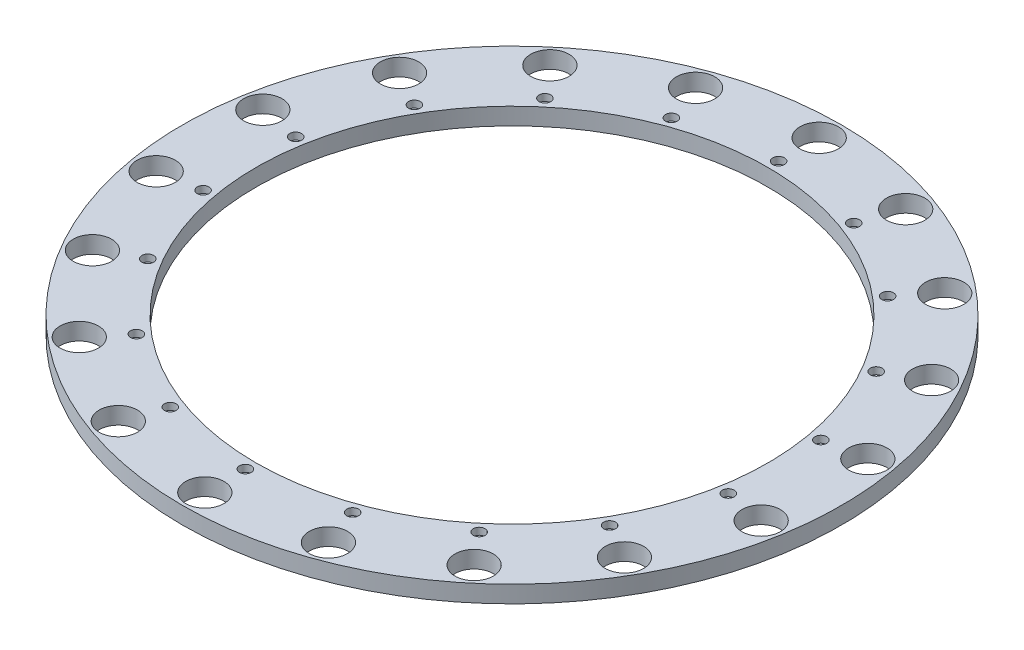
ISO-10303-21;
HEADER;
FILE_DESCRIPTION(('STEP AP214'),'2;1');
FILE_NAME('part.step','',(''),(''),'','','');
FILE_SCHEMA(('AUTOMOTIVE_DESIGN { 1 0 10303 214 1 1 1 1 }'));
ENDSEC;
DATA;
#1=APPLICATION_CONTEXT('core data for automotive mechanical design processes');
#2=APPLICATION_PROTOCOL_DEFINITION('international standard','automotive_design',2000,#1);
#3=PRODUCT_CONTEXT('',#1,'mechanical');
#4=PRODUCT('Part','Part','',(#3));
#5=PRODUCT_RELATED_PRODUCT_CATEGORY('part','',(#4));
#6=PRODUCT_DEFINITION_FORMATION('','',#4);
#7=PRODUCT_DEFINITION_CONTEXT('part definition',#1,'design');
#8=PRODUCT_DEFINITION('design','',#6,#7);
#9=PRODUCT_DEFINITION_SHAPE('','',#8);
#10=(LENGTH_UNIT() NAMED_UNIT(*) SI_UNIT(.MILLI.,.METRE.));
#11=(NAMED_UNIT(*) PLANE_ANGLE_UNIT() SI_UNIT($,.RADIAN.));
#12=(NAMED_UNIT(*) SI_UNIT($,.STERADIAN.) SOLID_ANGLE_UNIT());
#13=UNCERTAINTY_MEASURE_WITH_UNIT(LENGTH_MEASURE(1.E-05),#10,'distance_accuracy_value','');
#14=(GEOMETRIC_REPRESENTATION_CONTEXT(3) GLOBAL_UNCERTAINTY_ASSIGNED_CONTEXT((#13)) GLOBAL_UNIT_ASSIGNED_CONTEXT((#10,
#11,#12)) REPRESENTATION_CONTEXT('',''));
#15=CARTESIAN_POINT('',(0.,0.,0.));
#16=DIRECTION('',(0.,0.,1.));
#17=DIRECTION('',(1.,0.,0.));
#18=AXIS2_PLACEMENT_3D('',#15,#16,#17);
#19=CARTESIAN_POINT('',(0.,12.7,0.));
#20=DIRECTION('',(0.,1.,0.));
#21=DIRECTION('',(0.,0.,1.));
#22=AXIS2_PLACEMENT_3D('',#19,#20,#21);
#23=PLANE('',#22);
#24=CARTESIAN_POINT('',(171.851916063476,12.7000000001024,-99.2187499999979));
#25=DIRECTION('',(0.,-1.,0.));
#26=DIRECTION('',(-0.342020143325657,0.,-0.939692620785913));
#27=AXIS2_PLACEMENT_3D('',#24,#25,#26);
#28=CIRCLE('',#27,4.365625);
#29=CARTESIAN_POINT('',(170.35878437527,12.7000000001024,-103.321095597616));
#30=VERTEX_POINT('',#29);
#31=EDGE_CURVE('E502',#30,#30,#28,.T.);
#32=ORIENTED_EDGE('',*,*,#31,.T.);
#33=EDGE_LOOP('',(#32));
#34=FACE_BOUND('',#33,.T.);
#35=CARTESIAN_POINT('',(67.8696221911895,12.7000000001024,-186.470254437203));
#36=DIRECTION('',(0.,-1.,0.));
#37=DIRECTION('',(-0.866025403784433,0.,-0.50000000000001));
#38=AXIS2_PLACEMENT_3D('',#35,#36,#37);
#39=CIRCLE('',#38,4.365625);
#40=CARTESIAN_POINT('',(64.0888800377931,12.7000000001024,-188.653066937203));
#41=VERTEX_POINT('',#40);
#42=EDGE_CURVE('E484',#41,#41,#39,.T.);
#43=ORIENTED_EDGE('',*,*,#42,.T.);
#44=EDGE_LOOP('',(#43));
#45=FACE_BOUND('',#44,.T.);
#46=CARTESIAN_POINT('',(-67.8696221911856,12.7000000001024,-186.470254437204));
#47=DIRECTION('',(0.,-1.,0.));
#48=DIRECTION('',(-0.98480775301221,0.,0.173648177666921));
#49=AXIS2_PLACEMENT_3D('',#46,#47,#48);
#50=CIRCLE('',#49,4.365625);
#51=CARTESIAN_POINT('',(-72.1689235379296,12.7000000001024,-185.712171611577));
#52=VERTEX_POINT('',#51);
#53=EDGE_CURVE('E463',#52,#52,#50,.T.);
#54=ORIENTED_EDGE('',*,*,#53,.T.);
#55=EDGE_LOOP('',(#54));
#56=FACE_BOUND('',#55,.T.);
#57=CARTESIAN_POINT('',(-171.851916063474,12.7000000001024,-99.2187500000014));
#58=DIRECTION('',(0.,-1.,0.));
#59=DIRECTION('',(-0.642787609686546,0.,0.766044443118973));
#60=AXIS2_PLACEMENT_3D('',#57,#58,#59);
#61=CIRCLE('',#60,4.365625);
#62=CARTESIAN_POINT('',(-174.658085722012,12.7000000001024,-95.8744872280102));
#63=VERTEX_POINT('',#62);
#64=EDGE_CURVE('E445',#63,#63,#61,.T.);
#65=ORIENTED_EDGE('',*,*,#64,.T.);
#66=EDGE_LOOP('',(#65));
#67=FACE_BOUND('',#66,.T.);
#68=CARTESIAN_POINT('',(-195.42278848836,12.7000000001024,34.4583102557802));
#69=DIRECTION('',(0.,-1.,0.));
#70=DIRECTION('',(0.,0.,1.));
#71=AXIS2_PLACEMENT_3D('',#68,#69,#70);
#72=CIRCLE('',#71,4.365625);
#73=CARTESIAN_POINT('',(-195.42278848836,12.7000000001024,38.8239352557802));
#74=VERTEX_POINT('',#73);
#75=EDGE_CURVE('E427',#74,#74,#72,.T.);
#76=ORIENTED_EDGE('',*,*,#75,.T.);
#77=EDGE_LOOP('',(#76));
#78=FACE_BOUND('',#77,.T.);
#79=CARTESIAN_POINT('',(-127.553166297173,12.7000000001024,152.011944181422));
#80=DIRECTION('',(0.,-1.,0.));
#81=DIRECTION('',(0.642787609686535,0.,0.766044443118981));
#82=AXIS2_PLACEMENT_3D('',#79,#80,#81);
#83=CIRCLE('',#82,4.365625);
#84=CARTESIAN_POINT('',(-124.746996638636,12.7000000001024,155.356206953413));
#85=VERTEX_POINT('',#84);
#86=EDGE_CURVE('E408',#85,#85,#83,.T.);
#87=ORIENTED_EDGE('',*,*,#86,.T.);
#88=EDGE_LOOP('',(#87));
#89=FACE_BOUND('',#88,.T.);
#90=CARTESIAN_POINT('',(-6.73072708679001E-13,12.7000000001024,198.4375));
#91=DIRECTION('',(0.,-1.,0.));
#92=DIRECTION('',(0.984807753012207,0.,0.173648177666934));
#93=AXIS2_PLACEMENT_3D('',#90,#91,#92);
#94=CIRCLE('',#93,4.365625);
#95=CARTESIAN_POINT('',(4.29930134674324,12.7000000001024,199.195582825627));
#96=VERTEX_POINT('',#95);
#97=EDGE_CURVE('E390',#96,#96,#94,.T.);
#98=ORIENTED_EDGE('',*,*,#97,.T.);
#99=EDGE_LOOP('',(#98));
#100=FACE_BOUND('',#99,.T.);
#101=CARTESIAN_POINT('',(127.553166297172,12.7000000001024,152.011944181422));
#102=DIRECTION('',(0.,-1.,0.));
#103=DIRECTION('',(0.86602540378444,0.,-0.499999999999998));
#104=AXIS2_PLACEMENT_3D('',#101,#102,#103);
#105=CIRCLE('',#104,4.365625);
#106=CARTESIAN_POINT('',(131.333908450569,12.7000000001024,149.829131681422));
#107=VERTEX_POINT('',#106);
#108=EDGE_CURVE('E372',#107,#107,#105,.T.);
#109=ORIENTED_EDGE('',*,*,#108,.T.);
#110=EDGE_LOOP('',(#109));
#111=FACE_BOUND('',#110,.T.);
#112=CARTESIAN_POINT('',(195.42278848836,12.7000000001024,34.4583102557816));
#113=DIRECTION('',(0.,-1.,0.));
#114=DIRECTION('',(0.342020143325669,0.,-0.939692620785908));
#115=AXIS2_PLACEMENT_3D('',#112,#113,#114);
#116=CIRCLE('',#115,4.365625);
#117=CARTESIAN_POINT('',(196.915920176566,12.7000000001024,30.3559646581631));
#118=VERTEX_POINT('',#117);
#119=EDGE_CURVE('E351',#118,#118,#116,.T.);
#120=ORIENTED_EDGE('',*,*,#119,.T.);
#121=EDGE_LOOP('',(#120));
#122=FACE_BOUND('',#121,.T.);
#123=CARTESIAN_POINT('',(197.973407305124,12.7,-114.299999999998));
#124=DIRECTION('',(0.,1.,0.));
#125=DIRECTION('',(-0.939692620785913,0.,0.342020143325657));
#126=AXIS2_PLACEMENT_3D('',#123,#124,#125);
#127=CIRCLE('',#126,14.2875);
#128=CARTESIAN_POINT('',(184.547548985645,12.7,-109.413387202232));
#129=VERTEX_POINT('',#128);
#130=EDGE_CURVE('E347',#129,#129,#127,.T.);
#131=ORIENTED_EDGE('',*,*,#130,.F.);
#132=EDGE_LOOP('',(#131));
#133=FACE_BOUND('',#132,.T.);
#134=CARTESIAN_POINT('',(146.941247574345,12.7,-175.117759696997));
#135=DIRECTION('',(0.,1.,0.));
#136=DIRECTION('',(-0.766044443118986,0.,0.64278760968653));
#137=AXIS2_PLACEMENT_3D('',#134,#135,#136);
#138=CIRCLE('',#137,14.2875);
#139=CARTESIAN_POINT('',(135.996387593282,12.7,-165.9339317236));
#140=VERTEX_POINT('',#139);
#141=EDGE_CURVE('E340',#140,#140,#138,.T.);
#142=ORIENTED_EDGE('',*,*,#141,.F.);
#143=EDGE_LOOP('',(#142));
#144=FACE_BOUND('',#143,.T.);
#145=CARTESIAN_POINT('',(78.1858047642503,12.7,-214.813733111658));
#146=DIRECTION('',(0.,1.,0.));
#147=DIRECTION('',(-0.50000000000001,0.,0.866025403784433));
#148=AXIS2_PLACEMENT_3D('',#145,#146,#147);
#149=CIRCLE('',#148,14.2875);
#150=CARTESIAN_POINT('',(71.0420547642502,12.7,-202.440395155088));
#151=VERTEX_POINT('',#150);
#152=EDGE_CURVE('E333',#151,#151,#149,.T.);
#153=ORIENTED_EDGE('',*,*,#152,.F.);
#154=EDGE_LOOP('',(#153));
#155=FACE_BOUND('',#154,.T.);
#156=CARTESIAN_POINT('',(2.27595720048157E-12,12.7,-228.6));
#157=DIRECTION('',(0.,1.,0.));
#158=DIRECTION('',(-0.17364817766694,0.,0.984807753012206));
#159=AXIS2_PLACEMENT_3D('',#156,#157,#158);
#160=CIRCLE('',#159,14.2875);
#161=CARTESIAN_POINT('',(-2.48099833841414,12.7,-214.529559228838));
#162=VERTEX_POINT('',#161);
#163=EDGE_CURVE('E327',#162,#162,#160,.T.);
#164=ORIENTED_EDGE('',*,*,#163,.F.);
#165=EDGE_LOOP('',(#164));
#166=FACE_BOUND('',#165,.T.);
#167=CARTESIAN_POINT('',(-78.1858047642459,12.7,-214.813733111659));
#168=DIRECTION('',(0.,1.,0.));
#169=DIRECTION('',(0.173648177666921,0.,0.98480775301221));
#170=AXIS2_PLACEMENT_3D('',#167,#168,#169);
#171=CIRCLE('',#170,14.2875);
#172=CARTESIAN_POINT('',(-75.7048064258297,12.7,-200.743292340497));
#173=VERTEX_POINT('',#172);
#174=EDGE_CURVE('E321',#173,#173,#171,.T.);
#175=ORIENTED_EDGE('',*,*,#174,.F.);
#176=EDGE_LOOP('',(#175));
#177=FACE_BOUND('',#176,.T.);
#178=CARTESIAN_POINT('',(-146.941247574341,12.7,-175.117759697));
#179=DIRECTION('',(0.,1.,0.));
#180=DIRECTION('',(0.499999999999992,0.,0.866025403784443));
#181=AXIS2_PLACEMENT_3D('',#178,#179,#180);
#182=CIRCLE('',#181,14.2875);
#183=CARTESIAN_POINT('',(-139.797497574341,12.7,-162.744421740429));
#184=VERTEX_POINT('',#183);
#185=EDGE_CURVE('E315',#184,#184,#182,.T.);
#186=ORIENTED_EDGE('',*,*,#185,.F.);
#187=EDGE_LOOP('',(#186));
#188=FACE_BOUND('',#187,.T.);
#189=CARTESIAN_POINT('',(-197.973407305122,12.7,-114.300000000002));
#190=DIRECTION('',(0.,1.,0.));
#191=DIRECTION('',(0.766044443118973,0.,0.642787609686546));
#192=AXIS2_PLACEMENT_3D('',#189,#190,#191);
#193=CIRCLE('',#192,14.2875);
#194=CARTESIAN_POINT('',(-187.02854732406,12.7,-105.116172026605));
#195=VERTEX_POINT('',#194);
#196=EDGE_CURVE('E309',#195,#195,#193,.T.);
#197=ORIENTED_EDGE('',*,*,#196,.F.);
#198=EDGE_LOOP('',(#197));
#199=FACE_BOUND('',#198,.T.);
#200=CARTESIAN_POINT('',(-225.127052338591,12.7,-39.6959734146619));
#201=DIRECTION('',(0.,1.,0.));
#202=DIRECTION('',(0.939692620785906,0.,0.342020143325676));
#203=AXIS2_PLACEMENT_3D('',#200,#201,#202);
#204=CIRCLE('',#203,14.2875);
#205=CARTESIAN_POINT('',(-211.701194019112,12.7,-34.8093606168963));
#206=VERTEX_POINT('',#205);
#207=EDGE_CURVE('E303',#206,#206,#204,.T.);
#208=ORIENTED_EDGE('',*,*,#207,.F.);
#209=EDGE_LOOP('',(#208));
#210=FACE_BOUND('',#209,.T.);
#211=CARTESIAN_POINT('',(-225.127052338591,12.7,39.6959734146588));
#212=DIRECTION('',(0.,1.,0.));
#213=DIRECTION('',(1.,0.,0.));
#214=AXIS2_PLACEMENT_3D('',#211,#212,#213);
#215=CIRCLE('',#214,14.2875);
#216=CARTESIAN_POINT('',(-210.839552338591,12.7,39.6959734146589));
#217=VERTEX_POINT('',#216);
#218=EDGE_CURVE('E297',#217,#217,#215,.T.);
#219=ORIENTED_EDGE('',*,*,#218,.F.);
#220=EDGE_LOOP('',(#219));
#221=FACE_BOUND('',#220,.T.);
#222=CARTESIAN_POINT('',(-197.973407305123,12.7,114.299999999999));
#223=DIRECTION('',(0.,1.,0.));
#224=DIRECTION('',(0.939692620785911,0.,-0.342020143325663));
#225=AXIS2_PLACEMENT_3D('',#222,#223,#224);
#226=CIRCLE('',#225,14.2875);
#227=CARTESIAN_POINT('',(-184.547548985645,12.7,109.413387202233));
#228=VERTEX_POINT('',#227);
#229=EDGE_CURVE('E290',#228,#228,#226,.T.);
#230=ORIENTED_EDGE('',*,*,#229,.F.);
#231=EDGE_LOOP('',(#230));
#232=FACE_BOUND('',#231,.T.);
#233=CARTESIAN_POINT('',(-146.941247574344,12.7,175.117759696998));
#234=DIRECTION('',(0.,1.,0.));
#235=DIRECTION('',(0.766044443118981,0.,-0.642787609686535));
#236=AXIS2_PLACEMENT_3D('',#233,#234,#235);
#237=CIRCLE('',#236,14.2875);
#238=CARTESIAN_POINT('',(-135.996387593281,12.7,165.933931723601));
#239=VERTEX_POINT('',#238);
#240=EDGE_CURVE('E284',#239,#239,#237,.T.);
#241=ORIENTED_EDGE('',*,*,#240,.F.);
#242=EDGE_LOOP('',(#241));
#243=FACE_BOUND('',#242,.T.);
#244=CARTESIAN_POINT('',(-78.1858047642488,12.7,214.813733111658));
#245=DIRECTION('',(0.,1.,0.));
#246=DIRECTION('',(0.500000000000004,0.,-0.866025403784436));
#247=AXIS2_PLACEMENT_3D('',#244,#245,#246);
#248=CIRCLE('',#247,14.2875);
#249=CARTESIAN_POINT('',(-71.0420547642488,12.7,202.440395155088));
#250=VERTEX_POINT('',#249);
#251=EDGE_CURVE('E278',#250,#250,#248,.T.);
#252=ORIENTED_EDGE('',*,*,#251,.F.);
#253=EDGE_LOOP('',(#252));
#254=FACE_BOUND('',#253,.T.);
#255=CARTESIAN_POINT('',(-7.7715611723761E-13,12.7,228.6));
#256=DIRECTION('',(0.,1.,0.));
#257=DIRECTION('',(0.173648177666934,0.,-0.984807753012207));
#258=AXIS2_PLACEMENT_3D('',#255,#256,#257);
#259=CIRCLE('',#258,14.2875);
#260=CARTESIAN_POINT('',(2.48099833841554,12.7,214.529559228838));
#261=VERTEX_POINT('',#260);
#262=EDGE_CURVE('E272',#261,#261,#259,.T.);
#263=ORIENTED_EDGE('',*,*,#262,.F.);
#264=EDGE_LOOP('',(#263));
#265=FACE_BOUND('',#264,.T.);
#266=CARTESIAN_POINT('',(78.1858047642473,12.7,214.813733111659));
#267=DIRECTION('',(0.,1.,0.));
#268=DIRECTION('',(-0.173648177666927,0.,-0.984807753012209));
#269=AXIS2_PLACEMENT_3D('',#266,#267,#268);
#270=CIRCLE('',#269,14.2875);
#271=CARTESIAN_POINT('',(75.7048064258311,12.7,200.743292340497));
#272=VERTEX_POINT('',#271);
#273=EDGE_CURVE('E266',#272,#272,#270,.T.);
#274=ORIENTED_EDGE('',*,*,#273,.F.);
#275=EDGE_LOOP('',(#274));
#276=FACE_BOUND('',#275,.T.);
#277=CARTESIAN_POINT('',(146.941247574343,12.7,175.117759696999));
#278=DIRECTION('',(0.,1.,0.));
#279=DIRECTION('',(-0.499999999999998,0.,-0.86602540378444));
#280=AXIS2_PLACEMENT_3D('',#277,#278,#279);
#281=CIRCLE('',#280,14.2875);
#282=CARTESIAN_POINT('',(139.797497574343,12.7,162.744421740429));
#283=VERTEX_POINT('',#282);
#284=EDGE_CURVE('E260',#283,#283,#281,.T.);
#285=ORIENTED_EDGE('',*,*,#284,.F.);
#286=EDGE_LOOP('',(#285));
#287=FACE_BOUND('',#286,.T.);
#288=CARTESIAN_POINT('',(197.973407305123,12.7,114.3));
#289=DIRECTION('',(0.,1.,0.));
#290=DIRECTION('',(-0.766044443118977,0.,-0.642787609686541));
#291=AXIS2_PLACEMENT_3D('',#288,#289,#290);
#292=CIRCLE('',#291,14.2875);
#293=CARTESIAN_POINT('',(187.02854732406,12.7,105.116172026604));
#294=VERTEX_POINT('',#293);
#295=EDGE_CURVE('E254',#294,#294,#292,.T.);
#296=ORIENTED_EDGE('',*,*,#295,.F.);
#297=EDGE_LOOP('',(#296));
#298=FACE_BOUND('',#297,.T.);
#299=CARTESIAN_POINT('',(225.127052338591,12.7,39.6959734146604));
#300=DIRECTION('',(0.,1.,0.));
#301=DIRECTION('',(-0.939692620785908,0.,-0.342020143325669));
#302=AXIS2_PLACEMENT_3D('',#299,#300,#301);
#303=CIRCLE('',#302,14.2875);
#304=CARTESIAN_POINT('',(211.701194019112,12.7,34.8093606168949));
#305=VERTEX_POINT('',#304);
#306=EDGE_CURVE('E248',#305,#305,#303,.T.);
#307=ORIENTED_EDGE('',*,*,#306,.F.);
#308=EDGE_LOOP('',(#307));
#309=FACE_BOUND('',#308,.T.);
#310=CARTESIAN_POINT('',(195.42278848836,12.7000000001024,-34.4583102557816));
#311=DIRECTION('',(0.,-1.,0.));
#312=DIRECTION('',(0.,0.,-1.));
#313=AXIS2_PLACEMENT_3D('',#310,#311,#312);
#314=CIRCLE('',#313,4.365625);
#315=CARTESIAN_POINT('',(195.42278848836,12.7000000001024,-38.8239352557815));
#316=VERTEX_POINT('',#315);
#317=EDGE_CURVE('E58',#316,#316,#314,.T.);
#318=ORIENTED_EDGE('',*,*,#317,.T.);
#319=EDGE_LOOP('',(#318));
#320=FACE_BOUND('',#319,.T.);
#321=CARTESIAN_POINT('',(0.,12.7,0.));
#322=DIRECTION('',(0.,1.,0.));
#323=DIRECTION('',(0.,0.,1.));
#324=AXIS2_PLACEMENT_3D('',#321,#322,#323);
#325=CIRCLE('',#324,245.26875);
#326=CARTESIAN_POINT('',(0.,12.7,245.26875));
#327=VERTEX_POINT('',#326);
#328=EDGE_CURVE('E10',#327,#327,#325,.T.);
#329=ORIENTED_EDGE('',*,*,#328,.T.);
#330=EDGE_LOOP('',(#329));
#331=FACE_BOUND('',#330,.T.);
#332=CARTESIAN_POINT('',(225.127052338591,12.7,-39.6959734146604));
#333=DIRECTION('',(0.,1.,0.));
#334=DIRECTION('',(-1.,0.,0.));
#335=AXIS2_PLACEMENT_3D('',#332,#333,#334);
#336=CIRCLE('',#335,14.2875);
#337=CARTESIAN_POINT('',(210.839552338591,12.7,-39.6959734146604));
#338=VERTEX_POINT('',#337);
#339=EDGE_CURVE('E68',#338,#338,#336,.T.);
#340=ORIENTED_EDGE('',*,*,#339,.F.);
#341=EDGE_LOOP('',(#340));
#342=FACE_BOUND('',#341,.T.);
#343=CARTESIAN_POINT('',(171.851916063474,12.7000000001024,99.2187500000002));
#344=DIRECTION('',(0.,-1.,0.));
#345=DIRECTION('',(0.642787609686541,0.,-0.766044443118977));
#346=AXIS2_PLACEMENT_3D('',#343,#344,#345);
#347=CIRCLE('',#346,4.365625);
#348=CARTESIAN_POINT('',(174.658085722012,12.7000000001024,95.8744872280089));
#349=VERTEX_POINT('',#348);
#350=EDGE_CURVE('E363',#349,#349,#347,.T.);
#351=ORIENTED_EDGE('',*,*,#350,.T.);
#352=EDGE_LOOP('',(#351));
#353=FACE_BOUND('',#352,.T.);
#354=CARTESIAN_POINT('',(67.8696221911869,12.7000000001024,186.470254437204));
#355=DIRECTION('',(0.,-1.,0.));
#356=DIRECTION('',(0.984807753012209,0.,-0.173648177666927));
#357=AXIS2_PLACEMENT_3D('',#354,#355,#356);
#358=CIRCLE('',#357,4.365625);
#359=CARTESIAN_POINT('',(72.1689235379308,12.7000000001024,185.712171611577));
#360=VERTEX_POINT('',#359);
#361=EDGE_CURVE('E381',#360,#360,#358,.T.);
#362=ORIENTED_EDGE('',*,*,#361,.T.);
#363=EDGE_LOOP('',(#362));
#364=FACE_BOUND('',#363,.T.);
#365=CARTESIAN_POINT('',(-67.8696221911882,12.7000000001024,186.470254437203));
#366=DIRECTION('',(0.,-1.,0.));
#367=DIRECTION('',(0.866025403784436,0.,0.500000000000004));
#368=AXIS2_PLACEMENT_3D('',#365,#366,#367);
#369=CIRCLE('',#368,4.365625);
#370=CARTESIAN_POINT('',(-64.0888800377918,12.7000000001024,188.653066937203));
#371=VERTEX_POINT('',#370);
#372=EDGE_CURVE('E399',#371,#371,#369,.T.);
#373=ORIENTED_EDGE('',*,*,#372,.T.);
#374=EDGE_LOOP('',(#373));
#375=FACE_BOUND('',#374,.T.);
#376=CARTESIAN_POINT('',(-171.851916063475,12.7000000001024,99.218749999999));
#377=DIRECTION('',(0.,-1.,0.));
#378=DIRECTION('',(0.342020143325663,0.,0.939692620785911));
#379=AXIS2_PLACEMENT_3D('',#376,#377,#378);
#380=CIRCLE('',#379,4.365625);
#381=CARTESIAN_POINT('',(-170.358784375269,12.7000000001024,103.321095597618));
#382=VERTEX_POINT('',#381);
#383=EDGE_CURVE('E417',#382,#382,#380,.T.);
#384=ORIENTED_EDGE('',*,*,#383,.T.);
#385=EDGE_LOOP('',(#384));
#386=FACE_BOUND('',#385,.T.);
#387=CARTESIAN_POINT('',(-195.42278848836,12.7000000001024,-34.4583102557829));
#388=DIRECTION('',(0.,-1.,0.));
#389=DIRECTION('',(-0.342020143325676,0.,0.939692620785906));
#390=AXIS2_PLACEMENT_3D('',#387,#388,#389);
#391=CIRCLE('',#390,4.365625);
#392=CARTESIAN_POINT('',(-196.915920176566,12.7000000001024,-30.3559646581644));
#393=VERTEX_POINT('',#392);
#394=EDGE_CURVE('E436',#393,#393,#391,.T.);
#395=ORIENTED_EDGE('',*,*,#394,.T.);
#396=EDGE_LOOP('',(#395));
#397=FACE_BOUND('',#396,.T.);
#398=CARTESIAN_POINT('',(-127.553166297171,12.7000000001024,-152.011944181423));
#399=DIRECTION('',(0.,-1.,0.));
#400=DIRECTION('',(-0.866025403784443,0.,0.499999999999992));
#401=AXIS2_PLACEMENT_3D('',#398,#399,#400);
#402=CIRCLE('',#401,4.365625);
#403=CARTESIAN_POINT('',(-131.333908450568,12.7000000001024,-149.829131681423));
#404=VERTEX_POINT('',#403);
#405=EDGE_CURVE('E454',#404,#404,#402,.T.);
#406=ORIENTED_EDGE('',*,*,#405,.T.);
#407=EDGE_LOOP('',(#406));
#408=FACE_BOUND('',#407,.T.);
#409=CARTESIAN_POINT('',(1.97758476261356E-12,12.7000000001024,-198.4375));
#410=DIRECTION('',(0.,-1.,0.));
#411=DIRECTION('',(-0.984807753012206,0.,-0.17364817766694));
#412=AXIS2_PLACEMENT_3D('',#409,#410,#411);
#413=CIRCLE('',#412,4.365625);
#414=CARTESIAN_POINT('',(-4.29930134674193,12.7000000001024,-199.195582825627));
#415=VERTEX_POINT('',#414);
#416=EDGE_CURVE('E475',#415,#415,#413,.T.);
#417=ORIENTED_EDGE('',*,*,#416,.T.);
#418=EDGE_LOOP('',(#417));
#419=FACE_BOUND('',#418,.T.);
#420=CARTESIAN_POINT('',(127.553166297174,12.7000000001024,-152.011944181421));
#421=DIRECTION('',(0.,-1.,0.));
#422=DIRECTION('',(-0.64278760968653,0.,-0.766044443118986));
#423=AXIS2_PLACEMENT_3D('',#420,#421,#422);
#424=CIRCLE('',#423,4.365625);
#425=CARTESIAN_POINT('',(124.746996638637,12.7000000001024,-155.356206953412));
#426=VERTEX_POINT('',#425);
#427=EDGE_CURVE('E493',#426,#426,#424,.T.);
#428=ORIENTED_EDGE('',*,*,#427,.T.);
#429=EDGE_LOOP('',(#428));
#430=FACE_BOUND('',#429,.T.);
#431=CARTESIAN_POINT('',(0.,12.7000000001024,0.));
#432=DIRECTION('',(0.,1.,0.));
#433=DIRECTION('',(0.,0.,1.));
#434=AXIS2_PLACEMENT_3D('',#431,#432,#433);
#435=CIRCLE('',#434,190.5);
#436=CARTESIAN_POINT('',(0.,12.7000000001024,190.5));
#437=VERTEX_POINT('',#436);
#438=EDGE_CURVE('E514',#437,#437,#435,.T.);
#439=ORIENTED_EDGE('',*,*,#438,.F.);
#440=EDGE_LOOP('',(#439));
#441=FACE_BOUND('',#440,.T.);
#442=ADVANCED_FACE('F32',(#34,#45,#56,#67,#78,#89,#100,#111,#122,#133,#144,#155,#166,#177,#188,
#199,#210,#221,#232,#243,#254,#265,#276,#287,#298,#309,#320,#331,#342,#353,#364,#375,#386,#397,
#408,#419,#430,#441),#23,.T.);
#443=CARTESIAN_POINT('',(0.,0.,0.));
#444=DIRECTION('',(0.,1.,0.));
#445=DIRECTION('',(0.,0.,1.));
#446=AXIS2_PLACEMENT_3D('',#443,#444,#445);
#447=PLANE('',#446);
#448=CARTESIAN_POINT('',(171.851916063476,5.68429305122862E-11,-99.2187499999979));
#449=DIRECTION('',(0.,1.,0.));
#450=DIRECTION('',(0.342020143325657,0.,0.939692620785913));
#451=AXIS2_PLACEMENT_3D('',#448,#449,#450);
#452=CIRCLE('',#451,3.9878);
#453=CARTESIAN_POINT('',(173.21582399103,5.68429305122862E-11,-95.4714437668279));
#454=VERTEX_POINT('',#453);
#455=EDGE_CURVE('E243',#454,#454,#452,.T.);
#456=ORIENTED_EDGE('',*,*,#455,.T.);
#457=EDGE_LOOP('',(#456));
#458=FACE_BOUND('',#457,.T.);
#459=CARTESIAN_POINT('',(67.8696221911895,5.68429305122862E-11,-186.470254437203));
#460=DIRECTION('',(0.,1.,0.));
#461=DIRECTION('',(0.866025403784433,0.,0.50000000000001));
#462=AXIS2_PLACEMENT_3D('',#459,#460,#461);
#463=CIRCLE('',#462,3.9878);
#464=CARTESIAN_POINT('',(71.323158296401,5.68429305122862E-11,-184.476354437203));
#465=VERTEX_POINT('',#464);
#466=EDGE_CURVE('E219',#465,#465,#463,.T.);
#467=ORIENTED_EDGE('',*,*,#466,.T.);
#468=EDGE_LOOP('',(#467));
#469=FACE_BOUND('',#468,.T.);
#470=CARTESIAN_POINT('',(-67.8696221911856,5.68429305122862E-11,-186.470254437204));
#471=DIRECTION('',(0.,1.,0.));
#472=DIRECTION('',(0.98480775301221,0.,-0.173648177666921));
#473=AXIS2_PLACEMENT_3D('',#470,#471,#472);
#474=CIRCLE('',#473,3.9878);
#475=CARTESIAN_POINT('',(-63.9424058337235,5.68429305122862E-11,-187.162728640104));
#476=VERTEX_POINT('',#475);
#477=EDGE_CURVE('E197',#476,#476,#474,.T.);
#478=ORIENTED_EDGE('',*,*,#477,.T.);
#479=EDGE_LOOP('',(#478));
#480=FACE_BOUND('',#479,.T.);
#481=CARTESIAN_POINT('',(-171.851916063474,5.68429305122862E-11,-99.2187500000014));
#482=DIRECTION('',(0.,1.,0.));
#483=DIRECTION('',(0.642787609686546,0.,-0.766044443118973));
#484=AXIS2_PLACEMENT_3D('',#481,#482,#483);
#485=CIRCLE('',#484,3.9878);
#486=CARTESIAN_POINT('',(-169.288607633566,5.68429305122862E-11,-102.273582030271));
#487=VERTEX_POINT('',#486);
#488=EDGE_CURVE('E177',#487,#487,#485,.T.);
#489=ORIENTED_EDGE('',*,*,#488,.T.);
#490=EDGE_LOOP('',(#489));
#491=FACE_BOUND('',#490,.T.);
#492=CARTESIAN_POINT('',(-195.42278848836,5.68429305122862E-11,34.4583102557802));
#493=DIRECTION('',(0.,1.,0.));
#494=DIRECTION('',(0.,0.,-1.));
#495=AXIS2_PLACEMENT_3D('',#492,#493,#494);
#496=CIRCLE('',#495,3.9878);
#497=CARTESIAN_POINT('',(-195.42278848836,5.68429305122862E-11,30.4705102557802));
#498=VERTEX_POINT('',#497);
#499=EDGE_CURVE('E155',#498,#498,#496,.T.);
#500=ORIENTED_EDGE('',*,*,#499,.T.);
#501=EDGE_LOOP('',(#500));
#502=FACE_BOUND('',#501,.T.);
#503=CARTESIAN_POINT('',(-127.553166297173,5.68429305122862E-11,152.011944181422));
#504=DIRECTION('',(0.,1.,0.));
#505=DIRECTION('',(-0.642787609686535,0.,-0.766044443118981));
#506=AXIS2_PLACEMENT_3D('',#503,#504,#505);
#507=CIRCLE('',#506,3.9878);
#508=CARTESIAN_POINT('',(-130.116474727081,5.68429305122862E-11,148.957112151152));
#509=VERTEX_POINT('',#508);
#510=EDGE_CURVE('E136',#509,#509,#507,.T.);
#511=ORIENTED_EDGE('',*,*,#510,.T.);
#512=EDGE_LOOP('',(#511));
#513=FACE_BOUND('',#512,.T.);
#514=CARTESIAN_POINT('',(-6.73072708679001E-13,5.68429305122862E-11,198.4375));
#515=DIRECTION('',(0.,1.,0.));
#516=DIRECTION('',(-0.984807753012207,0.,-0.173648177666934));
#517=AXIS2_PLACEMENT_3D('',#514,#515,#516);
#518=CIRCLE('',#517,3.9878);
#519=CARTESIAN_POINT('',(-3.92721635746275,5.68429305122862E-11,197.7450257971));
#520=VERTEX_POINT('',#519);
#521=EDGE_CURVE('E117',#520,#520,#518,.T.);
#522=ORIENTED_EDGE('',*,*,#521,.T.);
#523=EDGE_LOOP('',(#522));
#524=FACE_BOUND('',#523,.T.);
#525=CARTESIAN_POINT('',(127.553166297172,5.68429305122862E-11,152.011944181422));
#526=DIRECTION('',(0.,1.,0.));
#527=DIRECTION('',(-0.86602540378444,0.,0.499999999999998));
#528=AXIS2_PLACEMENT_3D('',#525,#526,#527);
#529=CIRCLE('',#528,3.9878);
#530=CARTESIAN_POINT('',(124.099630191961,5.68429305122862E-11,154.005844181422));
#531=VERTEX_POINT('',#530);
#532=EDGE_CURVE('E99',#531,#531,#529,.T.);
#533=ORIENTED_EDGE('',*,*,#532,.T.);
#534=EDGE_LOOP('',(#533));
#535=FACE_BOUND('',#534,.T.);
#536=CARTESIAN_POINT('',(195.42278848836,5.68429305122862E-11,34.4583102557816));
#537=DIRECTION('',(0.,1.,0.));
#538=DIRECTION('',(-0.342020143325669,0.,0.939692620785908));
#539=AXIS2_PLACEMENT_3D('',#536,#537,#538);
#540=CIRCLE('',#539,3.9878);
#541=CARTESIAN_POINT('',(194.058880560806,5.68429305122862E-11,38.2056164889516));
#542=VERTEX_POINT('',#541);
#543=EDGE_CURVE('E80',#542,#542,#540,.T.);
#544=ORIENTED_EDGE('',*,*,#543,.T.);
#545=EDGE_LOOP('',(#544));
#546=FACE_BOUND('',#545,.T.);
#547=CARTESIAN_POINT('',(225.127052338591,0.,-39.6959734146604));
#548=DIRECTION('',(0.,1.,0.));
#549=DIRECTION('',(-1.,0.,0.));
#550=AXIS2_PLACEMENT_3D('',#547,#548,#549);
#551=CIRCLE('',#550,14.2875);
#552=CARTESIAN_POINT('',(210.839552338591,0.,-39.6959734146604));
#553=VERTEX_POINT('',#552);
#554=EDGE_CURVE('E67',#553,#553,#551,.T.);
#555=ORIENTED_EDGE('',*,*,#554,.T.);
#556=EDGE_LOOP('',(#555));
#557=FACE_BOUND('',#556,.T.);
#558=CARTESIAN_POINT('',(0.,0.,0.));
#559=DIRECTION('',(0.,1.,0.));
#560=DIRECTION('',(0.,0.,1.));
#561=AXIS2_PLACEMENT_3D('',#558,#559,#560);
#562=CIRCLE('',#561,245.26875);
#563=CARTESIAN_POINT('',(0.,0.,245.26875));
#564=VERTEX_POINT('',#563);
#565=EDGE_CURVE('E36',#564,#564,#562,.T.);
#566=ORIENTED_EDGE('',*,*,#565,.F.);
#567=EDGE_LOOP('',(#566));
#568=FACE_BOUND('',#567,.T.);
#569=CARTESIAN_POINT('',(195.42278848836,5.68429305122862E-11,-34.4583102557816));
#570=DIRECTION('',(0.,1.,0.));
#571=DIRECTION('',(0.,0.,1.));
#572=AXIS2_PLACEMENT_3D('',#569,#570,#571);
#573=CIRCLE('',#572,3.9878);
#574=CARTESIAN_POINT('',(195.42278848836,5.68429305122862E-11,-30.4705102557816));
#575=VERTEX_POINT('',#574);
#576=EDGE_CURVE('E54',#575,#575,#573,.T.);
#577=ORIENTED_EDGE('',*,*,#576,.T.);
#578=EDGE_LOOP('',(#577));
#579=FACE_BOUND('',#578,.T.);
#580=CARTESIAN_POINT('',(171.851916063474,5.68429305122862E-11,99.2187500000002));
#581=DIRECTION('',(0.,1.,0.));
#582=DIRECTION('',(-0.642787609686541,0.,0.766044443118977));
#583=AXIS2_PLACEMENT_3D('',#580,#581,#582);
#584=CIRCLE('',#583,3.9878);
#585=CARTESIAN_POINT('',(169.288607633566,5.68429305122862E-11,102.27358203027));
#586=VERTEX_POINT('',#585);
#587=EDGE_CURVE('E90',#586,#586,#584,.T.);
#588=ORIENTED_EDGE('',*,*,#587,.T.);
#589=EDGE_LOOP('',(#588));
#590=FACE_BOUND('',#589,.T.);
#591=CARTESIAN_POINT('',(67.8696221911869,5.68429305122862E-11,186.470254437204));
#592=DIRECTION('',(0.,1.,0.));
#593=DIRECTION('',(-0.984807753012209,0.,0.173648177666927));
#594=AXIS2_PLACEMENT_3D('',#591,#592,#593);
#595=CIRCLE('',#594,3.9878);
#596=CARTESIAN_POINT('',(63.9424058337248,5.68429305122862E-11,187.162728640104));
#597=VERTEX_POINT('',#596);
#598=EDGE_CURVE('E108',#597,#597,#595,.T.);
#599=ORIENTED_EDGE('',*,*,#598,.T.);
#600=EDGE_LOOP('',(#599));
#601=FACE_BOUND('',#600,.T.);
#602=CARTESIAN_POINT('',(-67.8696221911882,5.68429305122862E-11,186.470254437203));
#603=DIRECTION('',(0.,1.,0.));
#604=DIRECTION('',(-0.866025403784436,0.,-0.500000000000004));
#605=AXIS2_PLACEMENT_3D('',#602,#603,#604);
#606=CIRCLE('',#605,3.9878);
#607=CARTESIAN_POINT('',(-71.3231582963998,5.68429305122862E-11,184.476354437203));
#608=VERTEX_POINT('',#607);
#609=EDGE_CURVE('E126',#608,#608,#606,.T.);
#610=ORIENTED_EDGE('',*,*,#609,.T.);
#611=EDGE_LOOP('',(#610));
#612=FACE_BOUND('',#611,.T.);
#613=CARTESIAN_POINT('',(-171.851916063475,5.68429305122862E-11,99.218749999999));
#614=DIRECTION('',(0.,1.,0.));
#615=DIRECTION('',(-0.342020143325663,0.,-0.939692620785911));
#616=AXIS2_PLACEMENT_3D('',#613,#614,#615);
#617=CIRCLE('',#616,3.9878);
#618=CARTESIAN_POINT('',(-173.215823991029,5.68429305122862E-11,95.471443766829));
#619=VERTEX_POINT('',#618);
#620=EDGE_CURVE('E146',#619,#619,#617,.T.);
#621=ORIENTED_EDGE('',*,*,#620,.T.);
#622=EDGE_LOOP('',(#621));
#623=FACE_BOUND('',#622,.T.);
#624=CARTESIAN_POINT('',(-195.42278848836,5.68429305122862E-11,-34.4583102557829));
#625=DIRECTION('',(0.,1.,0.));
#626=DIRECTION('',(0.342020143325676,0.,-0.939692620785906));
#627=AXIS2_PLACEMENT_3D('',#624,#625,#626);
#628=CIRCLE('',#627,3.9878);
#629=CARTESIAN_POINT('',(-194.058880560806,5.68429305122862E-11,-38.2056164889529));
#630=VERTEX_POINT('',#629);
#631=EDGE_CURVE('E165',#630,#630,#628,.T.);
#632=ORIENTED_EDGE('',*,*,#631,.T.);
#633=EDGE_LOOP('',(#632));
#634=FACE_BOUND('',#633,.T.);
#635=CARTESIAN_POINT('',(-127.553166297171,5.68429305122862E-11,-152.011944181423));
#636=DIRECTION('',(0.,1.,0.));
#637=DIRECTION('',(0.866025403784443,0.,-0.499999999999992));
#638=AXIS2_PLACEMENT_3D('',#635,#636,#637);
#639=CIRCLE('',#638,3.9878);
#640=CARTESIAN_POINT('',(-124.09963019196,5.68429305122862E-11,-154.005844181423));
#641=VERTEX_POINT('',#640);
#642=EDGE_CURVE('E187',#641,#641,#639,.T.);
#643=ORIENTED_EDGE('',*,*,#642,.T.);
#644=EDGE_LOOP('',(#643));
#645=FACE_BOUND('',#644,.T.);
#646=CARTESIAN_POINT('',(1.97758476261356E-12,5.68429305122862E-11,-198.4375));
#647=DIRECTION('',(0.,1.,0.));
#648=DIRECTION('',(0.984807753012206,0.,0.17364817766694));
#649=AXIS2_PLACEMENT_3D('',#646,#647,#648);
#650=CIRCLE('',#649,3.9878);
#651=CARTESIAN_POINT('',(3.92721635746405,5.68429305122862E-11,-197.7450257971));
#652=VERTEX_POINT('',#651);
#653=EDGE_CURVE('E209',#652,#652,#650,.T.);
#654=ORIENTED_EDGE('',*,*,#653,.T.);
#655=EDGE_LOOP('',(#654));
#656=FACE_BOUND('',#655,.T.);
#657=CARTESIAN_POINT('',(127.553166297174,5.68429305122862E-11,-152.011944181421));
#658=DIRECTION('',(0.,1.,0.));
#659=DIRECTION('',(0.64278760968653,0.,0.766044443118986));
#660=AXIS2_PLACEMENT_3D('',#657,#658,#659);
#661=CIRCLE('',#660,3.9878);
#662=CARTESIAN_POINT('',(130.116474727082,5.68429305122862E-11,-148.957112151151));
#663=VERTEX_POINT('',#662);
#664=EDGE_CURVE('E231',#663,#663,#661,.T.);
#665=ORIENTED_EDGE('',*,*,#664,.T.);
#666=EDGE_LOOP('',(#665));
#667=FACE_BOUND('',#666,.T.);
#668=CARTESIAN_POINT('',(225.127052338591,0.,39.6959734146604));
#669=DIRECTION('',(0.,1.,0.));
#670=DIRECTION('',(-0.939692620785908,0.,-0.342020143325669));
#671=AXIS2_PLACEMENT_3D('',#668,#669,#670);
#672=CIRCLE('',#671,14.2875);
#673=CARTESIAN_POINT('',(211.701194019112,0.,34.8093606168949));
#674=VERTEX_POINT('',#673);
#675=EDGE_CURVE('E247',#674,#674,#672,.T.);
#676=ORIENTED_EDGE('',*,*,#675,.T.);
#677=EDGE_LOOP('',(#676));
#678=FACE_BOUND('',#677,.T.);
#679=CARTESIAN_POINT('',(197.973407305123,0.,114.3));
#680=DIRECTION('',(0.,1.,0.));
#681=DIRECTION('',(-0.766044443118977,0.,-0.642787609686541));
#682=AXIS2_PLACEMENT_3D('',#679,#680,#681);
#683=CIRCLE('',#682,14.2875);
#684=CARTESIAN_POINT('',(187.02854732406,0.,105.116172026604));
#685=VERTEX_POINT('',#684);
#686=EDGE_CURVE('E251',#685,#685,#683,.T.);
#687=ORIENTED_EDGE('',*,*,#686,.T.);
#688=EDGE_LOOP('',(#687));
#689=FACE_BOUND('',#688,.T.);
#690=CARTESIAN_POINT('',(146.941247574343,0.,175.117759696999));
#691=DIRECTION('',(0.,1.,0.));
#692=DIRECTION('',(-0.499999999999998,0.,-0.86602540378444));
#693=AXIS2_PLACEMENT_3D('',#690,#691,#692);
#694=CIRCLE('',#693,14.2875);
#695=CARTESIAN_POINT('',(139.797497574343,0.,162.744421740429));
#696=VERTEX_POINT('',#695);
#697=EDGE_CURVE('E257',#696,#696,#694,.T.);
#698=ORIENTED_EDGE('',*,*,#697,.T.);
#699=EDGE_LOOP('',(#698));
#700=FACE_BOUND('',#699,.T.);
#701=CARTESIAN_POINT('',(78.1858047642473,0.,214.813733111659));
#702=DIRECTION('',(0.,1.,0.));
#703=DIRECTION('',(-0.173648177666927,0.,-0.984807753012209));
#704=AXIS2_PLACEMENT_3D('',#701,#702,#703);
#705=CIRCLE('',#704,14.2875);
#706=CARTESIAN_POINT('',(75.7048064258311,0.,200.743292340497));
#707=VERTEX_POINT('',#706);
#708=EDGE_CURVE('E263',#707,#707,#705,.T.);
#709=ORIENTED_EDGE('',*,*,#708,.T.);
#710=EDGE_LOOP('',(#709));
#711=FACE_BOUND('',#710,.T.);
#712=CARTESIAN_POINT('',(-7.77156117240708E-13,0.,228.6));
#713=DIRECTION('',(0.,1.,0.));
#714=DIRECTION('',(0.173648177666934,0.,-0.984807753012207));
#715=AXIS2_PLACEMENT_3D('',#712,#713,#714);
#716=CIRCLE('',#715,14.2875);
#717=CARTESIAN_POINT('',(2.48099833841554,0.,214.529559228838));
#718=VERTEX_POINT('',#717);
#719=EDGE_CURVE('E269',#718,#718,#716,.T.);
#720=ORIENTED_EDGE('',*,*,#719,.T.);
#721=EDGE_LOOP('',(#720));
#722=FACE_BOUND('',#721,.T.);
#723=CARTESIAN_POINT('',(-78.1858047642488,0.,214.813733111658));
#724=DIRECTION('',(0.,1.,0.));
#725=DIRECTION('',(0.500000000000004,0.,-0.866025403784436));
#726=AXIS2_PLACEMENT_3D('',#723,#724,#725);
#727=CIRCLE('',#726,14.2875);
#728=CARTESIAN_POINT('',(-71.0420547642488,0.,202.440395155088));
#729=VERTEX_POINT('',#728);
#730=EDGE_CURVE('E275',#729,#729,#727,.T.);
#731=ORIENTED_EDGE('',*,*,#730,.T.);
#732=EDGE_LOOP('',(#731));
#733=FACE_BOUND('',#732,.T.);
#734=CARTESIAN_POINT('',(-146.941247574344,0.,175.117759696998));
#735=DIRECTION('',(0.,1.,0.));
#736=DIRECTION('',(0.766044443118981,0.,-0.642787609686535));
#737=AXIS2_PLACEMENT_3D('',#734,#735,#736);
#738=CIRCLE('',#737,14.2875);
#739=CARTESIAN_POINT('',(-135.996387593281,0.,165.933931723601));
#740=VERTEX_POINT('',#739);
#741=EDGE_CURVE('E281',#740,#740,#738,.T.);
#742=ORIENTED_EDGE('',*,*,#741,.T.);
#743=EDGE_LOOP('',(#742));
#744=FACE_BOUND('',#743,.T.);
#745=CARTESIAN_POINT('',(-197.973407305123,0.,114.299999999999));
#746=DIRECTION('',(0.,1.,0.));
#747=DIRECTION('',(0.939692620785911,0.,-0.342020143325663));
#748=AXIS2_PLACEMENT_3D('',#745,#746,#747);
#749=CIRCLE('',#748,14.2875);
#750=CARTESIAN_POINT('',(-184.547548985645,0.,109.413387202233));
#751=VERTEX_POINT('',#750);
#752=EDGE_CURVE('E287',#751,#751,#749,.T.);
#753=ORIENTED_EDGE('',*,*,#752,.T.);
#754=EDGE_LOOP('',(#753));
#755=FACE_BOUND('',#754,.T.);
#756=CARTESIAN_POINT('',(-225.127052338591,0.,39.6959734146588));
#757=DIRECTION('',(0.,1.,0.));
#758=DIRECTION('',(1.,0.,0.));
#759=AXIS2_PLACEMENT_3D('',#756,#757,#758);
#760=CIRCLE('',#759,14.2875);
#761=CARTESIAN_POINT('',(-210.839552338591,0.,39.6959734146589));
#762=VERTEX_POINT('',#761);
#763=EDGE_CURVE('E294',#762,#762,#760,.T.);
#764=ORIENTED_EDGE('',*,*,#763,.T.);
#765=EDGE_LOOP('',(#764));
#766=FACE_BOUND('',#765,.T.);
#767=CARTESIAN_POINT('',(-225.127052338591,0.,-39.6959734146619));
#768=DIRECTION('',(0.,1.,0.));
#769=DIRECTION('',(0.939692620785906,0.,0.342020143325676));
#770=AXIS2_PLACEMENT_3D('',#767,#768,#769);
#771=CIRCLE('',#770,14.2875);
#772=CARTESIAN_POINT('',(-211.701194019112,0.,-34.8093606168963));
#773=VERTEX_POINT('',#772);
#774=EDGE_CURVE('E300',#773,#773,#771,.T.);
#775=ORIENTED_EDGE('',*,*,#774,.T.);
#776=EDGE_LOOP('',(#775));
#777=FACE_BOUND('',#776,.T.);
#778=CARTESIAN_POINT('',(-197.973407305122,0.,-114.300000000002));
#779=DIRECTION('',(0.,1.,0.));
#780=DIRECTION('',(0.766044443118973,0.,0.642787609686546));
#781=AXIS2_PLACEMENT_3D('',#778,#779,#780);
#782=CIRCLE('',#781,14.2875);
#783=CARTESIAN_POINT('',(-187.02854732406,0.,-105.116172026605));
#784=VERTEX_POINT('',#783);
#785=EDGE_CURVE('E306',#784,#784,#782,.T.);
#786=ORIENTED_EDGE('',*,*,#785,.T.);
#787=EDGE_LOOP('',(#786));
#788=FACE_BOUND('',#787,.T.);
#789=CARTESIAN_POINT('',(-146.941247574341,0.,-175.117759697));
#790=DIRECTION('',(0.,1.,0.));
#791=DIRECTION('',(0.499999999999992,0.,0.866025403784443));
#792=AXIS2_PLACEMENT_3D('',#789,#790,#791);
#793=CIRCLE('',#792,14.2875);
#794=CARTESIAN_POINT('',(-139.797497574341,0.,-162.744421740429));
#795=VERTEX_POINT('',#794);
#796=EDGE_CURVE('E312',#795,#795,#793,.T.);
#797=ORIENTED_EDGE('',*,*,#796,.T.);
#798=EDGE_LOOP('',(#797));
#799=FACE_BOUND('',#798,.T.);
#800=CARTESIAN_POINT('',(-78.1858047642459,0.,-214.813733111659));
#801=DIRECTION('',(0.,1.,0.));
#802=DIRECTION('',(0.173648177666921,0.,0.98480775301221));
#803=AXIS2_PLACEMENT_3D('',#800,#801,#802);
#804=CIRCLE('',#803,14.2875);
#805=CARTESIAN_POINT('',(-75.7048064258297,0.,-200.743292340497));
#806=VERTEX_POINT('',#805);
#807=EDGE_CURVE('E318',#806,#806,#804,.T.);
#808=ORIENTED_EDGE('',*,*,#807,.T.);
#809=EDGE_LOOP('',(#808));
#810=FACE_BOUND('',#809,.T.);
#811=CARTESIAN_POINT('',(2.27595720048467E-12,0.,-228.6));
#812=DIRECTION('',(0.,1.,0.));
#813=DIRECTION('',(-0.17364817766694,0.,0.984807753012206));
#814=AXIS2_PLACEMENT_3D('',#811,#812,#813);
#815=CIRCLE('',#814,14.2875);
#816=CARTESIAN_POINT('',(-2.48099833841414,0.,-214.529559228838));
#817=VERTEX_POINT('',#816);
#818=EDGE_CURVE('E324',#817,#817,#815,.T.);
#819=ORIENTED_EDGE('',*,*,#818,.T.);
#820=EDGE_LOOP('',(#819));
#821=FACE_BOUND('',#820,.T.);
#822=CARTESIAN_POINT('',(78.1858047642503,0.,-214.813733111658));
#823=DIRECTION('',(0.,1.,0.));
#824=DIRECTION('',(-0.50000000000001,0.,0.866025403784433));
#825=AXIS2_PLACEMENT_3D('',#822,#823,#824);
#826=CIRCLE('',#825,14.2875);
#827=CARTESIAN_POINT('',(71.0420547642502,0.,-202.440395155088));
#828=VERTEX_POINT('',#827);
#829=EDGE_CURVE('E330',#828,#828,#826,.T.);
#830=ORIENTED_EDGE('',*,*,#829,.T.);
#831=EDGE_LOOP('',(#830));
#832=FACE_BOUND('',#831,.T.);
#833=CARTESIAN_POINT('',(146.941247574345,0.,-175.117759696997));
#834=DIRECTION('',(0.,1.,0.));
#835=DIRECTION('',(-0.766044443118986,0.,0.64278760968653));
#836=AXIS2_PLACEMENT_3D('',#833,#834,#835);
#837=CIRCLE('',#836,14.2875);
#838=CARTESIAN_POINT('',(135.996387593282,0.,-165.9339317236));
#839=VERTEX_POINT('',#838);
#840=EDGE_CURVE('E337',#839,#839,#837,.T.);
#841=ORIENTED_EDGE('',*,*,#840,.T.);
#842=EDGE_LOOP('',(#841));
#843=FACE_BOUND('',#842,.T.);
#844=CARTESIAN_POINT('',(197.973407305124,0.,-114.299999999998));
#845=DIRECTION('',(0.,1.,0.));
#846=DIRECTION('',(-0.939692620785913,0.,0.342020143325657));
#847=AXIS2_PLACEMENT_3D('',#844,#845,#846);
#848=CIRCLE('',#847,14.2875);
#849=CARTESIAN_POINT('',(184.547548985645,0.,-109.413387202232));
#850=VERTEX_POINT('',#849);
#851=EDGE_CURVE('E344',#850,#850,#848,.T.);
#852=ORIENTED_EDGE('',*,*,#851,.T.);
#853=EDGE_LOOP('',(#852));
#854=FACE_BOUND('',#853,.T.);
#855=CARTESIAN_POINT('',(0.,0.,0.));
#856=DIRECTION('',(0.,1.,0.));
#857=DIRECTION('',(0.,0.,1.));
#858=AXIS2_PLACEMENT_3D('',#855,#856,#857);
#859=CIRCLE('',#858,190.5);
#860=CARTESIAN_POINT('',(0.,0.,190.5));
#861=VERTEX_POINT('',#860);
#862=EDGE_CURVE('E515',#861,#861,#859,.T.);
#863=ORIENTED_EDGE('',*,*,#862,.T.);
#864=EDGE_LOOP('',(#863));
#865=FACE_BOUND('',#864,.T.);
#866=ADVANCED_FACE('F526',(#458,#469,#480,#491,#502,#513,#524,#535,#546,#557,#568,#579,#590,
#601,#612,#623,#634,#645,#656,#667,#678,#689,#700,#711,#722,#733,#744,#755,#766,#777,#788,#799,
#810,#821,#832,#843,#854,#865),#447,.F.);
#867=CARTESIAN_POINT('',(171.851916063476,5.6843418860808E-11,-99.2187499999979));
#868=DIRECTION('',(0.,1.,0.));
#869=DIRECTION('',(0.342020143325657,0.,0.939692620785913));
#870=AXIS2_PLACEMENT_3D('',#867,#868,#869);
#871=CYLINDRICAL_SURFACE('',#870,2.80670000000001);
#872=CARTESIAN_POINT('',(171.851916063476,3.17500000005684,-99.2187499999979));
#873=DIRECTION('',(0.,1.,0.));
#874=DIRECTION('',(0.342020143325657,0.,0.939692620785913));
#875=AXIS2_PLACEMENT_3D('',#872,#873,#874);
#876=CIRCLE('',#875,2.8067);
#877=CARTESIAN_POINT('',(172.811863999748,3.17500000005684,-96.5813147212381));
#878=VERTEX_POINT('',#877);
#879=EDGE_CURVE('E235',#878,#878,#876,.T.);
#880=ORIENTED_EDGE('',*,*,#879,.F.);
#881=EDGE_LOOP('',(#880));
#882=FACE_BOUND('',#881,.T.);
#883=CARTESIAN_POINT('',(171.851916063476,7.54062500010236,-99.2187499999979));
#884=DIRECTION('',(0.,-1.,0.));
#885=DIRECTION('',(-0.342020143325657,0.,-0.939692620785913));
#886=AXIS2_PLACEMENT_3D('',#883,#884,#885);
#887=CIRCLE('',#886,2.8067);
#888=CARTESIAN_POINT('',(170.891968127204,7.54062500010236,-101.856185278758));
#889=VERTEX_POINT('',#888);
#890=EDGE_CURVE('E510',#889,#889,#887,.T.);
#891=ORIENTED_EDGE('',*,*,#890,.F.);
#892=EDGE_LOOP('',(#891));
#893=FACE_BOUND('',#892,.T.);
#894=ADVANCED_FACE('F532',(#882,#893),#871,.F.);
#895=CARTESIAN_POINT('',(127.553166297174,5.6843418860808E-11,-152.011944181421));
#896=DIRECTION('',(0.,1.,0.));
#897=DIRECTION('',(0.64278760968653,0.,0.766044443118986));
#898=AXIS2_PLACEMENT_3D('',#895,#896,#897);
#899=CYLINDRICAL_SURFACE('',#898,2.80670000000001);
#900=CARTESIAN_POINT('',(127.553166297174,3.17500000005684,-152.011944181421));
#901=DIRECTION('',(0.,1.,0.));
#902=DIRECTION('',(0.64278760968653,0.,0.766044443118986));
#903=AXIS2_PLACEMENT_3D('',#900,#901,#902);
#904=CIRCLE('',#903,2.8067);
#905=CARTESIAN_POINT('',(129.357278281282,3.17500000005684,-149.861887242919));
#906=VERTEX_POINT('',#905);
#907=EDGE_CURVE('E223',#906,#906,#904,.T.);
#908=ORIENTED_EDGE('',*,*,#907,.F.);
#909=EDGE_LOOP('',(#908));
#910=FACE_BOUND('',#909,.T.);
#911=CARTESIAN_POINT('',(127.553166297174,7.54062500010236,-152.011944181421));
#912=DIRECTION('',(0.,-1.,0.));
#913=DIRECTION('',(-0.64278760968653,0.,-0.766044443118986));
#914=AXIS2_PLACEMENT_3D('',#911,#912,#913);
#915=CIRCLE('',#914,2.8067);
#916=CARTESIAN_POINT('',(125.749054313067,7.54062500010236,-154.162001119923));
#917=VERTEX_POINT('',#916);
#918=EDGE_CURVE('E499',#917,#917,#915,.T.);
#919=ORIENTED_EDGE('',*,*,#918,.F.);
#920=EDGE_LOOP('',(#919));
#921=FACE_BOUND('',#920,.T.);
#922=ADVANCED_FACE('F732',(#910,#921),#899,.F.);
#923=CARTESIAN_POINT('',(67.8696221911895,5.6843418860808E-11,-186.470254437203));
#924=DIRECTION('',(0.,1.,0.));
#925=DIRECTION('',(0.866025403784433,0.,0.50000000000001));
#926=AXIS2_PLACEMENT_3D('',#923,#924,#925);
#927=CYLINDRICAL_SURFACE('',#926,2.80670000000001);
#928=CARTESIAN_POINT('',(67.8696221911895,3.17500000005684,-186.470254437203));
#929=DIRECTION('',(0.,1.,0.));
#930=DIRECTION('',(0.866025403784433,0.,0.50000000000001));
#931=AXIS2_PLACEMENT_3D('',#928,#929,#930);
#932=CIRCLE('',#931,2.8067);
#933=CARTESIAN_POINT('',(70.3002956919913,3.17500000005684,-185.066904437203));
#934=VERTEX_POINT('',#933);
#935=EDGE_CURVE('E213',#934,#934,#932,.T.);
#936=ORIENTED_EDGE('',*,*,#935,.F.);
#937=EDGE_LOOP('',(#936));
#938=FACE_BOUND('',#937,.T.);
#939=CARTESIAN_POINT('',(67.8696221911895,7.54062500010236,-186.470254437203));
#940=DIRECTION('',(0.,-1.,0.));
#941=DIRECTION('',(-0.866025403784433,0.,-0.50000000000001));
#942=AXIS2_PLACEMENT_3D('',#939,#940,#941);
#943=CIRCLE('',#942,2.8067);
#944=CARTESIAN_POINT('',(65.4389486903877,7.54062500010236,-187.873604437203));
#945=VERTEX_POINT('',#944);
#946=EDGE_CURVE('E490',#945,#945,#943,.T.);
#947=ORIENTED_EDGE('',*,*,#946,.F.);
#948=EDGE_LOOP('',(#947));
#949=FACE_BOUND('',#948,.T.);
#950=ADVANCED_FACE('F720',(#938,#949),#927,.F.);
#951=CARTESIAN_POINT('',(1.97758476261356E-12,5.6843418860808E-11,-198.4375));
#952=DIRECTION('',(0.,1.,0.));
#953=DIRECTION('',(0.984807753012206,0.,0.17364817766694));
#954=AXIS2_PLACEMENT_3D('',#951,#952,#953);
#955=CYLINDRICAL_SURFACE('',#954,2.80670000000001);
#956=CARTESIAN_POINT('',(1.97758476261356E-12,3.17500000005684,-198.4375));
#957=DIRECTION('',(0.,1.,0.));
#958=DIRECTION('',(0.984807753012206,0.,0.17364817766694));
#959=AXIS2_PLACEMENT_3D('',#956,#957,#958);
#960=CIRCLE('',#959,2.8067);
#961=CARTESIAN_POINT('',(2.76405992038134,3.17500000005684,-197.950121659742));
#962=VERTEX_POINT('',#961);
#963=EDGE_CURVE('E201',#962,#962,#960,.T.);
#964=ORIENTED_EDGE('',*,*,#963,.F.);
#965=EDGE_LOOP('',(#964));
#966=FACE_BOUND('',#965,.T.);
#967=CARTESIAN_POINT('',(1.97758476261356E-12,7.54062500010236,-198.4375));
#968=DIRECTION('',(0.,-1.,0.));
#969=DIRECTION('',(-0.984807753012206,0.,-0.17364817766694));
#970=AXIS2_PLACEMENT_3D('',#967,#968,#969);
#971=CIRCLE('',#970,2.8067);
#972=CARTESIAN_POINT('',(-2.76405992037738,7.54062500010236,-198.924878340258));
#973=VERTEX_POINT('',#972);
#974=EDGE_CURVE('E481',#973,#973,#971,.T.);
#975=ORIENTED_EDGE('',*,*,#974,.F.);
#976=EDGE_LOOP('',(#975));
#977=FACE_BOUND('',#976,.T.);
#978=ADVANCED_FACE('F708',(#966,#977),#955,.F.);
#979=CARTESIAN_POINT('',(-67.8696221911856,5.6843418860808E-11,-186.470254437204));
#980=DIRECTION('',(0.,1.,0.));
#981=DIRECTION('',(0.98480775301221,0.,-0.173648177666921));
#982=AXIS2_PLACEMENT_3D('',#979,#980,#981);
#983=CYLINDRICAL_SURFACE('',#982,2.80670000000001);
#984=CARTESIAN_POINT('',(-67.8696221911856,3.17500000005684,-186.470254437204));
#985=DIRECTION('',(0.,1.,0.));
#986=DIRECTION('',(0.98480775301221,0.,-0.173648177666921));
#987=AXIS2_PLACEMENT_3D('',#984,#985,#986);
#988=CIRCLE('',#987,2.8067);
#989=CARTESIAN_POINT('',(-65.1055622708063,3.17500000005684,-186.957632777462));
#990=VERTEX_POINT('',#989);
#991=EDGE_CURVE('E191',#990,#990,#988,.T.);
#992=ORIENTED_EDGE('',*,*,#991,.F.);
#993=EDGE_LOOP('',(#992));
#994=FACE_BOUND('',#993,.T.);
#995=CARTESIAN_POINT('',(-67.8696221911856,7.54062500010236,-186.470254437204));
#996=DIRECTION('',(0.,-1.,0.));
#997=DIRECTION('',(-0.98480775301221,0.,0.173648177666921));
#998=AXIS2_PLACEMENT_3D('',#995,#996,#997);
#999=CIRCLE('',#998,2.8067);
#1000=CARTESIAN_POINT('',(-70.633682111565,7.54062500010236,-185.982876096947));
#1001=VERTEX_POINT('',#1000);
#1002=EDGE_CURVE('E471',#1001,#1001,#999,.T.);
#1003=ORIENTED_EDGE('',*,*,#1002,.F.);
#1004=EDGE_LOOP('',(#1003));
#1005=FACE_BOUND('',#1004,.T.);
#1006=ADVANCED_FACE('F696',(#994,#1005),#983,.F.);
#1007=CARTESIAN_POINT('',(-127.553166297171,5.6843418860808E-11,-152.011944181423));
#1008=DIRECTION('',(0.,1.,0.));
#1009=DIRECTION('',(0.866025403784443,0.,-0.499999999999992));
#1010=AXIS2_PLACEMENT_3D('',#1007,#1008,#1009);
#1011=CYLINDRICAL_SURFACE('',#1010,2.80670000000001);
#1012=CARTESIAN_POINT('',(-127.553166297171,3.17500000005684,-152.011944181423));
#1013=DIRECTION('',(0.,1.,0.));
#1014=DIRECTION('',(0.866025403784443,0.,-0.499999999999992));
#1015=AXIS2_PLACEMENT_3D('',#1012,#1013,#1014);
#1016=CIRCLE('',#1015,2.8067);
#1017=CARTESIAN_POINT('',(-125.122492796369,3.17500000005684,-153.415294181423));
#1018=VERTEX_POINT('',#1017);
#1019=EDGE_CURVE('E181',#1018,#1018,#1016,.T.);
#1020=ORIENTED_EDGE('',*,*,#1019,.F.);
#1021=EDGE_LOOP('',(#1020));
#1022=FACE_BOUND('',#1021,.T.);
#1023=CARTESIAN_POINT('',(-127.553166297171,7.54062500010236,-152.011944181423));
#1024=DIRECTION('',(0.,-1.,0.));
#1025=DIRECTION('',(-0.866025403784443,0.,0.499999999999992));
#1026=AXIS2_PLACEMENT_3D('',#1023,#1024,#1025);
#1027=CIRCLE('',#1026,2.8067);
#1028=CARTESIAN_POINT('',(-129.983839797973,7.54062500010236,-150.608594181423));
#1029=VERTEX_POINT('',#1028);
#1030=EDGE_CURVE('E460',#1029,#1029,#1027,.T.);
#1031=ORIENTED_EDGE('',*,*,#1030,.F.);
#1032=EDGE_LOOP('',(#1031));
#1033=FACE_BOUND('',#1032,.T.);
#1034=ADVANCED_FACE('F684',(#1022,#1033),#1011,.F.);
#1035=CARTESIAN_POINT('',(-171.851916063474,5.6843418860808E-11,-99.2187500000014));
#1036=DIRECTION('',(0.,1.,0.));
#1037=DIRECTION('',(0.642787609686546,0.,-0.766044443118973));
#1038=AXIS2_PLACEMENT_3D('',#1035,#1036,#1037);
#1039=CYLINDRICAL_SURFACE('',#1038,2.80670000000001);
#1040=CARTESIAN_POINT('',(-171.851916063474,3.17500000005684,-99.2187500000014));
#1041=DIRECTION('',(0.,1.,0.));
#1042=DIRECTION('',(0.642787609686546,0.,-0.766044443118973));
#1043=AXIS2_PLACEMENT_3D('',#1040,#1041,#1042);
#1044=CIRCLE('',#1043,2.8067);
#1045=CARTESIAN_POINT('',(-170.047804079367,3.17500000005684,-101.368806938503));
#1046=VERTEX_POINT('',#1045);
#1047=EDGE_CURVE('E169',#1046,#1046,#1044,.T.);
#1048=ORIENTED_EDGE('',*,*,#1047,.F.);
#1049=EDGE_LOOP('',(#1048));
#1050=FACE_BOUND('',#1049,.T.);
#1051=CARTESIAN_POINT('',(-171.851916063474,7.54062500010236,-99.2187500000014));
#1052=DIRECTION('',(0.,-1.,0.));
#1053=DIRECTION('',(-0.642787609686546,0.,0.766044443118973));
#1054=AXIS2_PLACEMENT_3D('',#1051,#1052,#1053);
#1055=CIRCLE('',#1054,2.8067);
#1056=CARTESIAN_POINT('',(-173.656028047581,7.54062500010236,-97.0686930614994));
#1057=VERTEX_POINT('',#1056);
#1058=EDGE_CURVE('E451',#1057,#1057,#1055,.T.);
#1059=ORIENTED_EDGE('',*,*,#1058,.F.);
#1060=EDGE_LOOP('',(#1059));
#1061=FACE_BOUND('',#1060,.T.);
#1062=ADVANCED_FACE('F672',(#1050,#1061),#1039,.F.);
#1063=CARTESIAN_POINT('',(-195.42278848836,5.6843418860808E-11,-34.4583102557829));
#1064=DIRECTION('',(0.,1.,0.));
#1065=DIRECTION('',(0.342020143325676,0.,-0.939692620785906));
#1066=AXIS2_PLACEMENT_3D('',#1063,#1064,#1065);
#1067=CYLINDRICAL_SURFACE('',#1066,2.80670000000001);
#1068=CARTESIAN_POINT('',(-195.42278848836,3.17500000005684,-34.4583102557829));
#1069=DIRECTION('',(0.,1.,0.));
#1070=DIRECTION('',(0.342020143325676,0.,-0.939692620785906));
#1071=AXIS2_PLACEMENT_3D('',#1068,#1069,#1070);
#1072=CIRCLE('',#1071,2.8067);
#1073=CARTESIAN_POINT('',(-194.462840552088,3.17500000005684,-37.0957455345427));
#1074=VERTEX_POINT('',#1073);
#1075=EDGE_CURVE('E159',#1074,#1074,#1072,.T.);
#1076=ORIENTED_EDGE('',*,*,#1075,.F.);
#1077=EDGE_LOOP('',(#1076));
#1078=FACE_BOUND('',#1077,.T.);
#1079=CARTESIAN_POINT('',(-195.42278848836,7.54062500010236,-34.4583102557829));
#1080=DIRECTION('',(0.,-1.,0.));
#1081=DIRECTION('',(-0.342020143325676,0.,0.939692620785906));
#1082=AXIS2_PLACEMENT_3D('',#1079,#1080,#1081);
#1083=CIRCLE('',#1082,2.8067);
#1084=CARTESIAN_POINT('',(-196.382736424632,7.54062500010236,-31.8208749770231));
#1085=VERTEX_POINT('',#1084);
#1086=EDGE_CURVE('E442',#1085,#1085,#1083,.T.);
#1087=ORIENTED_EDGE('',*,*,#1086,.F.);
#1088=EDGE_LOOP('',(#1087));
#1089=FACE_BOUND('',#1088,.T.);
#1090=ADVANCED_FACE('F660',(#1078,#1089),#1067,.F.);
#1091=CARTESIAN_POINT('',(-195.42278848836,5.6843418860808E-11,34.4583102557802));
#1092=DIRECTION('',(0.,1.,0.));
#1093=DIRECTION('',(0.,0.,-1.));
#1094=AXIS2_PLACEMENT_3D('',#1091,#1092,#1093);
#1095=CYLINDRICAL_SURFACE('',#1094,2.80670000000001);
#1096=CARTESIAN_POINT('',(-195.42278848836,3.17500000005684,34.4583102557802));
#1097=DIRECTION('',(0.,1.,0.));
#1098=DIRECTION('',(0.,0.,-1.));
#1099=AXIS2_PLACEMENT_3D('',#1096,#1097,#1098);
#1100=CIRCLE('',#1099,2.8067);
#1101=CARTESIAN_POINT('',(-195.42278848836,3.17500000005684,31.6516102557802));
#1102=VERTEX_POINT('',#1101);
#1103=EDGE_CURVE('E149',#1102,#1102,#1100,.T.);
#1104=ORIENTED_EDGE('',*,*,#1103,.F.);
#1105=EDGE_LOOP('',(#1104));
#1106=FACE_BOUND('',#1105,.T.);
#1107=CARTESIAN_POINT('',(-195.42278848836,7.54062500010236,34.4583102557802));
#1108=DIRECTION('',(0.,-1.,0.));
#1109=DIRECTION('',(0.,0.,1.));
#1110=AXIS2_PLACEMENT_3D('',#1107,#1108,#1109);
#1111=CIRCLE('',#1110,2.8067);
#1112=CARTESIAN_POINT('',(-195.42278848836,7.54062500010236,37.2650102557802));
#1113=VERTEX_POINT('',#1112);
#1114=EDGE_CURVE('E433',#1113,#1113,#1111,.T.);
#1115=ORIENTED_EDGE('',*,*,#1114,.F.);
#1116=EDGE_LOOP('',(#1115));
#1117=FACE_BOUND('',#1116,.T.);
#1118=ADVANCED_FACE('F648',(#1106,#1117),#1095,.F.);
#1119=CARTESIAN_POINT('',(-171.851916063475,5.6843418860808E-11,99.218749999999));
#1120=DIRECTION('',(0.,1.,0.));
#1121=DIRECTION('',(-0.342020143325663,0.,-0.939692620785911));
#1122=AXIS2_PLACEMENT_3D('',#1119,#1120,#1121);
#1123=CYLINDRICAL_SURFACE('',#1122,2.80670000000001);
#1124=CARTESIAN_POINT('',(-171.851916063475,3.17500000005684,99.218749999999));
#1125=DIRECTION('',(0.,1.,0.));
#1126=DIRECTION('',(-0.342020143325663,0.,-0.939692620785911));
#1127=AXIS2_PLACEMENT_3D('',#1124,#1125,#1126);
#1128=CIRCLE('',#1127,2.8067);
#1129=CARTESIAN_POINT('',(-172.811863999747,3.17500000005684,96.5813147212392));
#1130=VERTEX_POINT('',#1129);
#1131=EDGE_CURVE('E140',#1130,#1130,#1128,.T.);
#1132=ORIENTED_EDGE('',*,*,#1131,.F.);
#1133=EDGE_LOOP('',(#1132));
#1134=FACE_BOUND('',#1133,.T.);
#1135=CARTESIAN_POINT('',(-171.851916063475,7.54062500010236,99.218749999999));
#1136=DIRECTION('',(0.,-1.,0.));
#1137=DIRECTION('',(0.342020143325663,0.,0.939692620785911));
#1138=AXIS2_PLACEMENT_3D('',#1135,#1136,#1137);
#1139=CIRCLE('',#1138,2.8067);
#1140=CARTESIAN_POINT('',(-170.891968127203,7.54062500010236,101.856185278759));
#1141=VERTEX_POINT('',#1140);
#1142=EDGE_CURVE('E423',#1141,#1141,#1139,.T.);
#1143=ORIENTED_EDGE('',*,*,#1142,.F.);
#1144=EDGE_LOOP('',(#1143));
#1145=FACE_BOUND('',#1144,.T.);
#1146=ADVANCED_FACE('F636',(#1134,#1145),#1123,.F.);
#1147=CARTESIAN_POINT('',(-127.553166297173,5.6843418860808E-11,152.011944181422));
#1148=DIRECTION('',(0.,1.,0.));
#1149=DIRECTION('',(-0.642787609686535,0.,-0.766044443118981));
#1150=AXIS2_PLACEMENT_3D('',#1147,#1148,#1149);
#1151=CYLINDRICAL_SURFACE('',#1150,2.80670000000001);
#1152=CARTESIAN_POINT('',(-127.553166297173,3.17500000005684,152.011944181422));
#1153=DIRECTION('',(0.,1.,0.));
#1154=DIRECTION('',(-0.642787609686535,0.,-0.766044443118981));
#1155=AXIS2_PLACEMENT_3D('',#1152,#1153,#1154);
#1156=CIRCLE('',#1155,2.8067);
#1157=CARTESIAN_POINT('',(-129.357278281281,3.17500000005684,149.86188724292));
#1158=VERTEX_POINT('',#1157);
#1159=EDGE_CURVE('E130',#1158,#1158,#1156,.T.);
#1160=ORIENTED_EDGE('',*,*,#1159,.F.);
#1161=EDGE_LOOP('',(#1160));
#1162=FACE_BOUND('',#1161,.T.);
#1163=CARTESIAN_POINT('',(-127.553166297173,7.54062500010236,152.011944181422));
#1164=DIRECTION('',(0.,-1.,0.));
#1165=DIRECTION('',(0.642787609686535,0.,0.766044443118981));
#1166=AXIS2_PLACEMENT_3D('',#1163,#1164,#1165);
#1167=CIRCLE('',#1166,2.8067);
#1168=CARTESIAN_POINT('',(-125.749054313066,7.54062500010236,154.162001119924));
#1169=VERTEX_POINT('',#1168);
#1170=EDGE_CURVE('E414',#1169,#1169,#1167,.T.);
#1171=ORIENTED_EDGE('',*,*,#1170,.F.);
#1172=EDGE_LOOP('',(#1171));
#1173=FACE_BOUND('',#1172,.T.);
#1174=ADVANCED_FACE('F624',(#1162,#1173),#1151,.F.);
#1175=CARTESIAN_POINT('',(-67.8696221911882,5.6843418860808E-11,186.470254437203));
#1176=DIRECTION('',(0.,1.,0.));
#1177=DIRECTION('',(-0.866025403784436,0.,-0.500000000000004));
#1178=AXIS2_PLACEMENT_3D('',#1175,#1176,#1177);
#1179=CYLINDRICAL_SURFACE('',#1178,2.80670000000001);
#1180=CARTESIAN_POINT('',(-67.8696221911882,3.17500000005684,186.470254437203));
#1181=DIRECTION('',(0.,1.,0.));
#1182=DIRECTION('',(-0.866025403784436,0.,-0.500000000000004));
#1183=AXIS2_PLACEMENT_3D('',#1180,#1181,#1182);
#1184=CIRCLE('',#1183,2.8067);
#1185=CARTESIAN_POINT('',(-70.30029569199,3.17500000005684,185.066904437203));
#1186=VERTEX_POINT('',#1185);
#1187=EDGE_CURVE('E120',#1186,#1186,#1184,.T.);
#1188=ORIENTED_EDGE('',*,*,#1187,.F.);
#1189=EDGE_LOOP('',(#1188));
#1190=FACE_BOUND('',#1189,.T.);
#1191=CARTESIAN_POINT('',(-67.8696221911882,7.54062500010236,186.470254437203));
#1192=DIRECTION('',(0.,-1.,0.));
#1193=DIRECTION('',(0.866025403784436,0.,0.500000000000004));
#1194=AXIS2_PLACEMENT_3D('',#1191,#1192,#1193);
#1195=CIRCLE('',#1194,2.8067);
#1196=CARTESIAN_POINT('',(-65.4389486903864,7.54062500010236,187.873604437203));
#1197=VERTEX_POINT('',#1196);
#1198=EDGE_CURVE('E405',#1197,#1197,#1195,.T.);
#1199=ORIENTED_EDGE('',*,*,#1198,.F.);
#1200=EDGE_LOOP('',(#1199));
#1201=FACE_BOUND('',#1200,.T.);
#1202=ADVANCED_FACE('F612',(#1190,#1201),#1179,.F.);
#1203=CARTESIAN_POINT('',(-6.73072708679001E-13,5.6843418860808E-11,198.4375));
#1204=DIRECTION('',(0.,1.,0.));
#1205=DIRECTION('',(-0.984807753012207,0.,-0.173648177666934));
#1206=AXIS2_PLACEMENT_3D('',#1203,#1204,#1205);
#1207=CYLINDRICAL_SURFACE('',#1206,2.80670000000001);
#1208=CARTESIAN_POINT('',(-6.73072708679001E-13,3.17500000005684,198.4375));
#1209=DIRECTION('',(0.,1.,0.));
#1210=DIRECTION('',(-0.984807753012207,0.,-0.173648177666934));
#1211=AXIS2_PLACEMENT_3D('',#1208,#1209,#1210);
#1212=CIRCLE('',#1211,2.8067);
#1213=CARTESIAN_POINT('',(-2.76405992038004,3.17500000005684,197.950121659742));
#1214=VERTEX_POINT('',#1213);
#1215=EDGE_CURVE('E111',#1214,#1214,#1212,.T.);
#1216=ORIENTED_EDGE('',*,*,#1215,.F.);
#1217=EDGE_LOOP('',(#1216));
#1218=FACE_BOUND('',#1217,.T.);
#1219=CARTESIAN_POINT('',(-6.73072708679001E-13,7.54062500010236,198.4375));
#1220=DIRECTION('',(0.,-1.,0.));
#1221=DIRECTION('',(0.984807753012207,0.,0.173648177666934));
#1222=AXIS2_PLACEMENT_3D('',#1219,#1220,#1221);
#1223=CIRCLE('',#1222,2.8067);
#1224=CARTESIAN_POINT('',(2.76405992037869,7.54062500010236,198.924878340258));
#1225=VERTEX_POINT('',#1224);
#1226=EDGE_CURVE('E396',#1225,#1225,#1223,.T.);
#1227=ORIENTED_EDGE('',*,*,#1226,.F.);
#1228=EDGE_LOOP('',(#1227));
#1229=FACE_BOUND('',#1228,.T.);
#1230=ADVANCED_FACE('F600',(#1218,#1229),#1207,.F.);
#1231=CARTESIAN_POINT('',(67.8696221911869,5.6843418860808E-11,186.470254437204));
#1232=DIRECTION('',(0.,1.,0.));
#1233=DIRECTION('',(-0.984807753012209,0.,0.173648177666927));
#1234=AXIS2_PLACEMENT_3D('',#1231,#1232,#1233);
#1235=CYLINDRICAL_SURFACE('',#1234,2.80670000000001);
#1236=CARTESIAN_POINT('',(67.8696221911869,3.17500000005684,186.470254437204));
#1237=DIRECTION('',(0.,1.,0.));
#1238=DIRECTION('',(-0.984807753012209,0.,0.173648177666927));
#1239=AXIS2_PLACEMENT_3D('',#1236,#1237,#1238);
#1240=CIRCLE('',#1239,2.8067);
#1241=CARTESIAN_POINT('',(65.1055622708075,3.17500000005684,186.957632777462));
#1242=VERTEX_POINT('',#1241);
#1243=EDGE_CURVE('E102',#1242,#1242,#1240,.T.);
#1244=ORIENTED_EDGE('',*,*,#1243,.F.);
#1245=EDGE_LOOP('',(#1244));
#1246=FACE_BOUND('',#1245,.T.);
#1247=CARTESIAN_POINT('',(67.8696221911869,7.54062500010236,186.470254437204));
#1248=DIRECTION('',(0.,-1.,0.));
#1249=DIRECTION('',(0.984807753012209,0.,-0.173648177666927));
#1250=AXIS2_PLACEMENT_3D('',#1247,#1248,#1249);
#1251=CIRCLE('',#1250,2.8067);
#1252=CARTESIAN_POINT('',(70.6336821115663,7.54062500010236,185.982876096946));
#1253=VERTEX_POINT('',#1252);
#1254=EDGE_CURVE('E387',#1253,#1253,#1251,.T.);
#1255=ORIENTED_EDGE('',*,*,#1254,.F.);
#1256=EDGE_LOOP('',(#1255));
#1257=FACE_BOUND('',#1256,.T.);
#1258=ADVANCED_FACE('F588',(#1246,#1257),#1235,.F.);
#1259=CARTESIAN_POINT('',(127.553166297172,5.6843418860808E-11,152.011944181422));
#1260=DIRECTION('',(0.,1.,0.));
#1261=DIRECTION('',(-0.86602540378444,0.,0.499999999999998));
#1262=AXIS2_PLACEMENT_3D('',#1259,#1260,#1261);
#1263=CYLINDRICAL_SURFACE('',#1262,2.80670000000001);
#1264=CARTESIAN_POINT('',(127.553166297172,3.17500000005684,152.011944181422));
#1265=DIRECTION('',(0.,1.,0.));
#1266=DIRECTION('',(-0.86602540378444,0.,0.499999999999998));
#1267=AXIS2_PLACEMENT_3D('',#1264,#1265,#1266);
#1268=CIRCLE('',#1267,2.8067);
#1269=CARTESIAN_POINT('',(125.122492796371,3.17500000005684,153.415294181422));
#1270=VERTEX_POINT('',#1269);
#1271=EDGE_CURVE('E93',#1270,#1270,#1268,.T.);
#1272=ORIENTED_EDGE('',*,*,#1271,.F.);
#1273=EDGE_LOOP('',(#1272));
#1274=FACE_BOUND('',#1273,.T.);
#1275=CARTESIAN_POINT('',(127.553166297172,7.54062500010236,152.011944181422));
#1276=DIRECTION('',(0.,-1.,0.));
#1277=DIRECTION('',(0.86602540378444,0.,-0.499999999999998));
#1278=AXIS2_PLACEMENT_3D('',#1275,#1276,#1277);
#1279=CIRCLE('',#1278,2.8067);
#1280=CARTESIAN_POINT('',(129.983839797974,7.54062500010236,150.608594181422));
#1281=VERTEX_POINT('',#1280);
#1282=EDGE_CURVE('E378',#1281,#1281,#1279,.T.);
#1283=ORIENTED_EDGE('',*,*,#1282,.F.);
#1284=EDGE_LOOP('',(#1283));
#1285=FACE_BOUND('',#1284,.T.);
#1286=ADVANCED_FACE('F576',(#1274,#1285),#1263,.F.);
#1287=CARTESIAN_POINT('',(171.851916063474,5.6843418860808E-11,99.2187500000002));
#1288=DIRECTION('',(0.,1.,0.));
#1289=DIRECTION('',(-0.642787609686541,0.,0.766044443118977));
#1290=AXIS2_PLACEMENT_3D('',#1287,#1288,#1289);
#1291=CYLINDRICAL_SURFACE('',#1290,2.80670000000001);
#1292=CARTESIAN_POINT('',(171.851916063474,3.17500000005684,99.2187500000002));
#1293=DIRECTION('',(0.,1.,0.));
#1294=DIRECTION('',(-0.642787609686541,0.,0.766044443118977));
#1295=AXIS2_PLACEMENT_3D('',#1292,#1293,#1294);
#1296=CIRCLE('',#1295,2.8067);
#1297=CARTESIAN_POINT('',(170.047804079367,3.17500000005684,101.368806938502));
#1298=VERTEX_POINT('',#1297);
#1299=EDGE_CURVE('E84',#1298,#1298,#1296,.T.);
#1300=ORIENTED_EDGE('',*,*,#1299,.F.);
#1301=EDGE_LOOP('',(#1300));
#1302=FACE_BOUND('',#1301,.T.);
#1303=CARTESIAN_POINT('',(171.851916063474,7.54062500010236,99.2187500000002));
#1304=DIRECTION('',(0.,-1.,0.));
#1305=DIRECTION('',(0.642787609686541,0.,-0.766044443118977));
#1306=AXIS2_PLACEMENT_3D('',#1303,#1304,#1305);
#1307=CIRCLE('',#1306,2.8067);
#1308=CARTESIAN_POINT('',(173.656028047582,7.54062500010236,97.0686930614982));
#1309=VERTEX_POINT('',#1308);
#1310=EDGE_CURVE('E369',#1309,#1309,#1307,.T.);
#1311=ORIENTED_EDGE('',*,*,#1310,.F.);
#1312=EDGE_LOOP('',(#1311));
#1313=FACE_BOUND('',#1312,.T.);
#1314=ADVANCED_FACE('F564',(#1302,#1313),#1291,.F.);
#1315=CARTESIAN_POINT('',(195.42278848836,5.6843418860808E-11,34.4583102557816));
#1316=DIRECTION('',(0.,1.,0.));
#1317=DIRECTION('',(-0.342020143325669,0.,0.939692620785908));
#1318=AXIS2_PLACEMENT_3D('',#1315,#1316,#1317);
#1319=CYLINDRICAL_SURFACE('',#1318,2.80670000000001);
#1320=CARTESIAN_POINT('',(195.42278848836,3.17500000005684,34.4583102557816));
#1321=DIRECTION('',(0.,1.,0.));
#1322=DIRECTION('',(-0.342020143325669,0.,0.939692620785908));
#1323=AXIS2_PLACEMENT_3D('',#1320,#1321,#1322);
#1324=CIRCLE('',#1323,2.8067);
#1325=CARTESIAN_POINT('',(194.462840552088,3.17500000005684,37.0957455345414));
#1326=VERTEX_POINT('',#1325);
#1327=EDGE_CURVE('E72',#1326,#1326,#1324,.T.);
#1328=ORIENTED_EDGE('',*,*,#1327,.F.);
#1329=EDGE_LOOP('',(#1328));
#1330=FACE_BOUND('',#1329,.T.);
#1331=CARTESIAN_POINT('',(195.42278848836,7.54062500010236,34.4583102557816));
#1332=DIRECTION('',(0.,-1.,0.));
#1333=DIRECTION('',(0.342020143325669,0.,-0.939692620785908));
#1334=AXIS2_PLACEMENT_3D('',#1331,#1332,#1333);
#1335=CIRCLE('',#1334,2.8067);
#1336=CARTESIAN_POINT('',(196.382736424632,7.54062500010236,31.8208749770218));
#1337=VERTEX_POINT('',#1336);
#1338=EDGE_CURVE('E360',#1337,#1337,#1335,.T.);
#1339=ORIENTED_EDGE('',*,*,#1338,.F.);
#1340=EDGE_LOOP('',(#1339));
#1341=FACE_BOUND('',#1340,.T.);
#1342=ADVANCED_FACE('F539',(#1330,#1341),#1319,.F.);
#1343=CARTESIAN_POINT('',(195.42278848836,5.6843418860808E-11,-34.4583102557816));
#1344=DIRECTION('',(0.,1.,0.));
#1345=DIRECTION('',(0.,0.,1.));
#1346=AXIS2_PLACEMENT_3D('',#1343,#1344,#1345);
#1347=CYLINDRICAL_SURFACE('',#1346,2.80670000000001);
#1348=CARTESIAN_POINT('',(195.42278848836,3.17500000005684,-34.4583102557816));
#1349=DIRECTION('',(0.,1.,0.));
#1350=DIRECTION('',(0.,0.,1.));
#1351=AXIS2_PLACEMENT_3D('',#1348,#1349,#1350);
#1352=CIRCLE('',#1351,2.8067);
#1353=CARTESIAN_POINT('',(195.42278848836,3.17500000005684,-31.6516102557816));
#1354=VERTEX_POINT('',#1353);
#1355=EDGE_CURVE('E47',#1354,#1354,#1352,.T.);
#1356=ORIENTED_EDGE('',*,*,#1355,.F.);
#1357=EDGE_LOOP('',(#1356));
#1358=FACE_BOUND('',#1357,.T.);
#1359=CARTESIAN_POINT('',(195.42278848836,7.54062500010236,-34.4583102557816));
#1360=DIRECTION('',(0.,-1.,0.));
#1361=DIRECTION('',(0.,0.,-1.));
#1362=AXIS2_PLACEMENT_3D('',#1359,#1360,#1361);
#1363=CIRCLE('',#1362,2.8067);
#1364=CARTESIAN_POINT('',(195.42278848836,7.54062500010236,-37.2650102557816));
#1365=VERTEX_POINT('',#1364);
#1366=EDGE_CURVE('E64',#1365,#1365,#1363,.T.);
#1367=ORIENTED_EDGE('',*,*,#1366,.F.);
#1368=EDGE_LOOP('',(#1367));
#1369=FACE_BOUND('',#1368,.T.);
#1370=ADVANCED_FACE('F536',(#1358,#1369),#1347,.F.);
#1371=CARTESIAN_POINT('',(0.,12.7,0.));
#1372=DIRECTION('',(0.,-1.,0.));
#1373=DIRECTION('',(0.,0.,-1.));
#1374=AXIS2_PLACEMENT_3D('',#1371,#1372,#1373);
#1375=CYLINDRICAL_SURFACE('',#1374,245.26875);
#1376=ORIENTED_EDGE('',*,*,#328,.F.);
#1377=EDGE_LOOP('',(#1376));
#1378=FACE_BOUND('',#1377,.T.);
#1379=ORIENTED_EDGE('',*,*,#565,.T.);
#1380=EDGE_LOOP('',(#1379));
#1381=FACE_BOUND('',#1380,.T.);
#1382=ADVANCED_FACE('F34',(#1378,#1381),#1375,.T.);
#1383=CARTESIAN_POINT('',(195.42278848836,3.17500000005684,-38.4461102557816));
#1384=DIRECTION('',(0.,-1.,0.));
#1385=DIRECTION('',(0.,0.,-1.));
#1386=AXIS2_PLACEMENT_3D('',#1383,#1384,#1385);
#1387=PLANE('',#1386);
#1388=ORIENTED_EDGE('',*,*,#1355,.T.);
#1389=EDGE_LOOP('',(#1388));
#1390=FACE_BOUND('',#1389,.T.);
#1391=CARTESIAN_POINT('',(195.42278848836,3.17500000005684,-34.4583102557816));
#1392=DIRECTION('',(0.,1.,0.));
#1393=DIRECTION('',(0.,0.,1.));
#1394=AXIS2_PLACEMENT_3D('',#1391,#1392,#1393);
#1395=CIRCLE('',#1394,3.9878);
#1396=CARTESIAN_POINT('',(195.42278848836,3.17500000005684,-30.4705102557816));
#1397=VERTEX_POINT('',#1396);
#1398=EDGE_CURVE('E51',#1397,#1397,#1395,.T.);
#1399=ORIENTED_EDGE('',*,*,#1398,.F.);
#1400=EDGE_LOOP('',(#1399));
#1401=FACE_BOUND('',#1400,.T.);
#1402=ADVANCED_FACE('F541',(#1390,#1401),#1387,.T.);
#1403=CARTESIAN_POINT('',(195.42278848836,5.6843418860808E-11,-34.4583102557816));
#1404=DIRECTION('',(0.,1.,0.));
#1405=DIRECTION('',(0.,0.,1.));
#1406=AXIS2_PLACEMENT_3D('',#1403,#1404,#1405);
#1407=CYLINDRICAL_SURFACE('',#1406,3.9878);
#1408=ORIENTED_EDGE('',*,*,#1398,.T.);
#1409=EDGE_LOOP('',(#1408));
#1410=FACE_BOUND('',#1409,.T.);
#1411=ORIENTED_EDGE('',*,*,#576,.F.);
#1412=EDGE_LOOP('',(#1411));
#1413=FACE_BOUND('',#1412,.T.);
#1414=ADVANCED_FACE('F544',(#1410,#1413),#1407,.F.);
#1415=CARTESIAN_POINT('',(195.42278848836,12.7000000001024,-34.4583102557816));
#1416=DIRECTION('',(0.,-1.,0.));
#1417=DIRECTION('',(0.,0.,-1.));
#1418=AXIS2_PLACEMENT_3D('',#1415,#1416,#1417);
#1419=CYLINDRICAL_SURFACE('',#1418,4.365625);
#1420=CARTESIAN_POINT('',(195.42278848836,7.54062500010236,-34.4583102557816));
#1421=DIRECTION('',(0.,-1.,0.));
#1422=DIRECTION('',(0.,0.,-1.));
#1423=AXIS2_PLACEMENT_3D('',#1420,#1421,#1422);
#1424=CIRCLE('',#1423,4.365625);
#1425=CARTESIAN_POINT('',(195.42278848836,7.54062500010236,-38.8239352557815));
#1426=VERTEX_POINT('',#1425);
#1427=EDGE_CURVE('E61',#1426,#1426,#1424,.T.);
#1428=ORIENTED_EDGE('',*,*,#1427,.T.);
#1429=EDGE_LOOP('',(#1428));
#1430=FACE_BOUND('',#1429,.T.);
#1431=ORIENTED_EDGE('',*,*,#317,.F.);
#1432=EDGE_LOOP('',(#1431));
#1433=FACE_BOUND('',#1432,.T.);
#1434=ADVANCED_FACE('F548',(#1430,#1433),#1419,.F.);
#1435=CARTESIAN_POINT('',(195.42278848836,7.54062500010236,-38.8239352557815));
#1436=DIRECTION('',(0.,1.,0.));
#1437=DIRECTION('',(0.,0.,1.));
#1438=AXIS2_PLACEMENT_3D('',#1435,#1436,#1437);
#1439=PLANE('',#1438);
#1440=ORIENTED_EDGE('',*,*,#1366,.T.);
#1441=EDGE_LOOP('',(#1440));
#1442=FACE_BOUND('',#1441,.T.);
#1443=ORIENTED_EDGE('',*,*,#1427,.F.);
#1444=EDGE_LOOP('',(#1443));
#1445=FACE_BOUND('',#1444,.T.);
#1446=ADVANCED_FACE('F552',(#1442,#1445),#1439,.T.);
#1447=CARTESIAN_POINT('',(225.127052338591,0.,-39.6959734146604));
#1448=DIRECTION('',(0.,1.,0.));
#1449=DIRECTION('',(-1.,0.,0.));
#1450=AXIS2_PLACEMENT_3D('',#1447,#1448,#1449);
#1451=CYLINDRICAL_SURFACE('',#1450,14.2875);
#1452=ORIENTED_EDGE('',*,*,#554,.F.);
#1453=EDGE_LOOP('',(#1452));
#1454=FACE_BOUND('',#1453,.T.);
#1455=ORIENTED_EDGE('',*,*,#339,.T.);
#1456=EDGE_LOOP('',(#1455));
#1457=FACE_BOUND('',#1456,.T.);
#1458=ADVANCED_FACE('F556',(#1454,#1457),#1451,.F.);
#1459=CARTESIAN_POINT('',(196.786696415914,3.17500000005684,30.7110040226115));
#1460=DIRECTION('',(0.,-1.,0.));
#1461=DIRECTION('',(0.342020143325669,0.,-0.939692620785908));
#1462=AXIS2_PLACEMENT_3D('',#1459,#1460,#1461);
#1463=PLANE('',#1462);
#1464=ORIENTED_EDGE('',*,*,#1327,.T.);
#1465=EDGE_LOOP('',(#1464));
#1466=FACE_BOUND('',#1465,.T.);
#1467=CARTESIAN_POINT('',(195.42278848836,3.17500000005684,34.4583102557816));
#1468=DIRECTION('',(0.,1.,0.));
#1469=DIRECTION('',(-0.342020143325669,0.,0.939692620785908));
#1470=AXIS2_PLACEMENT_3D('',#1467,#1468,#1469);
#1471=CIRCLE('',#1470,3.9878);
#1472=CARTESIAN_POINT('',(194.058880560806,3.17500000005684,38.2056164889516));
#1473=VERTEX_POINT('',#1472);
#1474=EDGE_CURVE('E77',#1473,#1473,#1471,.T.);
#1475=ORIENTED_EDGE('',*,*,#1474,.F.);
#1476=EDGE_LOOP('',(#1475));
#1477=FACE_BOUND('',#1476,.T.);
#1478=ADVANCED_FACE('F560',(#1466,#1477),#1463,.T.);
#1479=CARTESIAN_POINT('',(195.42278848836,5.6843418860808E-11,34.4583102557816));
#1480=DIRECTION('',(0.,1.,0.));
#1481=DIRECTION('',(-0.342020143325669,0.,0.939692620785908));
#1482=AXIS2_PLACEMENT_3D('',#1479,#1480,#1481);
#1483=CYLINDRICAL_SURFACE('',#1482,3.9878);
#1484=ORIENTED_EDGE('',*,*,#1474,.T.);
#1485=EDGE_LOOP('',(#1484));
#1486=FACE_BOUND('',#1485,.T.);
#1487=ORIENTED_EDGE('',*,*,#543,.F.);
#1488=EDGE_LOOP('',(#1487));
#1489=FACE_BOUND('',#1488,.T.);
#1490=ADVANCED_FACE('F568',(#1486,#1489),#1483,.F.);
#1491=CARTESIAN_POINT('',(174.415224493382,3.17500000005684,96.1639179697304));
#1492=DIRECTION('',(0.,-1.,0.));
#1493=DIRECTION('',(0.642787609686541,0.,-0.766044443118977));
#1494=AXIS2_PLACEMENT_3D('',#1491,#1492,#1493);
#1495=PLANE('',#1494);
#1496=ORIENTED_EDGE('',*,*,#1299,.T.);
#1497=EDGE_LOOP('',(#1496));
#1498=FACE_BOUND('',#1497,.T.);
#1499=CARTESIAN_POINT('',(171.851916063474,3.17500000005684,99.2187500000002));
#1500=DIRECTION('',(0.,1.,0.));
#1501=DIRECTION('',(-0.642787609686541,0.,0.766044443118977));
#1502=AXIS2_PLACEMENT_3D('',#1499,#1500,#1501);
#1503=CIRCLE('',#1502,3.9878);
#1504=CARTESIAN_POINT('',(169.288607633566,3.17500000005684,102.27358203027));
#1505=VERTEX_POINT('',#1504);
#1506=EDGE_CURVE('E87',#1505,#1505,#1503,.T.);
#1507=ORIENTED_EDGE('',*,*,#1506,.F.);
#1508=EDGE_LOOP('',(#1507));
#1509=FACE_BOUND('',#1508,.T.);
#1510=ADVANCED_FACE('F572',(#1498,#1509),#1495,.T.);
#1511=CARTESIAN_POINT('',(171.851916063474,5.6843418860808E-11,99.2187500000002));
#1512=DIRECTION('',(0.,1.,0.));
#1513=DIRECTION('',(-0.642787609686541,0.,0.766044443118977));
#1514=AXIS2_PLACEMENT_3D('',#1511,#1512,#1513);
#1515=CYLINDRICAL_SURFACE('',#1514,3.9878);
#1516=ORIENTED_EDGE('',*,*,#1506,.T.);
#1517=EDGE_LOOP('',(#1516));
#1518=FACE_BOUND('',#1517,.T.);
#1519=ORIENTED_EDGE('',*,*,#587,.F.);
#1520=EDGE_LOOP('',(#1519));
#1521=FACE_BOUND('',#1520,.T.);
#1522=ADVANCED_FACE('F580',(#1518,#1521),#1515,.F.);
#1523=CARTESIAN_POINT('',(131.006702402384,3.17500000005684,150.018044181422));
#1524=DIRECTION('',(0.,-1.,0.));
#1525=DIRECTION('',(0.86602540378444,0.,-0.499999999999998));
#1526=AXIS2_PLACEMENT_3D('',#1523,#1524,#1525);
#1527=PLANE('',#1526);
#1528=ORIENTED_EDGE('',*,*,#1271,.T.);
#1529=EDGE_LOOP('',(#1528));
#1530=FACE_BOUND('',#1529,.T.);
#1531=CARTESIAN_POINT('',(127.553166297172,3.17500000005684,152.011944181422));
#1532=DIRECTION('',(0.,1.,0.));
#1533=DIRECTION('',(-0.86602540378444,0.,0.499999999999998));
#1534=AXIS2_PLACEMENT_3D('',#1531,#1532,#1533);
#1535=CIRCLE('',#1534,3.9878);
#1536=CARTESIAN_POINT('',(124.099630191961,3.17500000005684,154.005844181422));
#1537=VERTEX_POINT('',#1536);
#1538=EDGE_CURVE('E96',#1537,#1537,#1535,.T.);
#1539=ORIENTED_EDGE('',*,*,#1538,.F.);
#1540=EDGE_LOOP('',(#1539));
#1541=FACE_BOUND('',#1540,.T.);
#1542=ADVANCED_FACE('F584',(#1530,#1541),#1527,.T.);
#1543=CARTESIAN_POINT('',(127.553166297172,5.6843418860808E-11,152.011944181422));
#1544=DIRECTION('',(0.,1.,0.));
#1545=DIRECTION('',(-0.86602540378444,0.,0.499999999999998));
#1546=AXIS2_PLACEMENT_3D('',#1543,#1544,#1545);
#1547=CYLINDRICAL_SURFACE('',#1546,3.9878);
#1548=ORIENTED_EDGE('',*,*,#1538,.T.);
#1549=EDGE_LOOP('',(#1548));
#1550=FACE_BOUND('',#1549,.T.);
#1551=ORIENTED_EDGE('',*,*,#532,.F.);
#1552=EDGE_LOOP('',(#1551));
#1553=FACE_BOUND('',#1552,.T.);
#1554=ADVANCED_FACE('F592',(#1550,#1553),#1547,.F.);
#1555=CARTESIAN_POINT('',(71.796838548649,3.17500000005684,185.777780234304));
#1556=DIRECTION('',(0.,-1.,0.));
#1557=DIRECTION('',(0.984807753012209,0.,-0.173648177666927));
#1558=AXIS2_PLACEMENT_3D('',#1555,#1556,#1557);
#1559=PLANE('',#1558);
#1560=ORIENTED_EDGE('',*,*,#1243,.T.);
#1561=EDGE_LOOP('',(#1560));
#1562=FACE_BOUND('',#1561,.T.);
#1563=CARTESIAN_POINT('',(67.8696221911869,3.17500000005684,186.470254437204));
#1564=DIRECTION('',(0.,1.,0.));
#1565=DIRECTION('',(-0.984807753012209,0.,0.173648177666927));
#1566=AXIS2_PLACEMENT_3D('',#1563,#1564,#1565);
#1567=CIRCLE('',#1566,3.9878);
#1568=CARTESIAN_POINT('',(63.9424058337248,3.17500000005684,187.162728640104));
#1569=VERTEX_POINT('',#1568);
#1570=EDGE_CURVE('E105',#1569,#1569,#1567,.T.);
#1571=ORIENTED_EDGE('',*,*,#1570,.F.);
#1572=EDGE_LOOP('',(#1571));
#1573=FACE_BOUND('',#1572,.T.);
#1574=ADVANCED_FACE('F596',(#1562,#1573),#1559,.T.);
#1575=CARTESIAN_POINT('',(67.8696221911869,5.6843418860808E-11,186.470254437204));
#1576=DIRECTION('',(0.,1.,0.));
#1577=DIRECTION('',(-0.984807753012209,0.,0.173648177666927));
#1578=AXIS2_PLACEMENT_3D('',#1575,#1576,#1577);
#1579=CYLINDRICAL_SURFACE('',#1578,3.9878);
#1580=ORIENTED_EDGE('',*,*,#1570,.T.);
#1581=EDGE_LOOP('',(#1580));
#1582=FACE_BOUND('',#1581,.T.);
#1583=ORIENTED_EDGE('',*,*,#598,.F.);
#1584=EDGE_LOOP('',(#1583));
#1585=FACE_BOUND('',#1584,.T.);
#1586=ADVANCED_FACE('F604',(#1582,#1585),#1579,.F.);
#1587=CARTESIAN_POINT('',(3.9272163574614,3.17500000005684,199.1299742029));
#1588=DIRECTION('',(0.,-1.,0.));
#1589=DIRECTION('',(0.984807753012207,0.,0.173648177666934));
#1590=AXIS2_PLACEMENT_3D('',#1587,#1588,#1589);
#1591=PLANE('',#1590);
#1592=ORIENTED_EDGE('',*,*,#1215,.T.);
#1593=EDGE_LOOP('',(#1592));
#1594=FACE_BOUND('',#1593,.T.);
#1595=CARTESIAN_POINT('',(-6.73072708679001E-13,3.17500000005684,198.4375));
#1596=DIRECTION('',(0.,1.,0.));
#1597=DIRECTION('',(-0.984807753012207,0.,-0.173648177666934));
#1598=AXIS2_PLACEMENT_3D('',#1595,#1596,#1597);
#1599=CIRCLE('',#1598,3.9878);
#1600=CARTESIAN_POINT('',(-3.92721635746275,3.17500000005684,197.7450257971));
#1601=VERTEX_POINT('',#1600);
#1602=EDGE_CURVE('E114',#1601,#1601,#1599,.T.);
#1603=ORIENTED_EDGE('',*,*,#1602,.F.);
#1604=EDGE_LOOP('',(#1603));
#1605=FACE_BOUND('',#1604,.T.);
#1606=ADVANCED_FACE('F608',(#1594,#1605),#1591,.T.);
#1607=CARTESIAN_POINT('',(-6.73072708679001E-13,5.6843418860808E-11,198.4375));
#1608=DIRECTION('',(0.,1.,0.));
#1609=DIRECTION('',(-0.984807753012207,0.,-0.173648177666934));
#1610=AXIS2_PLACEMENT_3D('',#1607,#1608,#1609);
#1611=CYLINDRICAL_SURFACE('',#1610,3.9878);
#1612=ORIENTED_EDGE('',*,*,#1602,.T.);
#1613=EDGE_LOOP('',(#1612));
#1614=FACE_BOUND('',#1613,.T.);
#1615=ORIENTED_EDGE('',*,*,#521,.F.);
#1616=EDGE_LOOP('',(#1615));
#1617=FACE_BOUND('',#1616,.T.);
#1618=ADVANCED_FACE('F616',(#1614,#1617),#1611,.F.);
#1619=CARTESIAN_POINT('',(-64.4160860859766,3.17500000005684,188.464154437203));
#1620=DIRECTION('',(0.,-1.,0.));
#1621=DIRECTION('',(0.866025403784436,0.,0.500000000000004));
#1622=AXIS2_PLACEMENT_3D('',#1619,#1620,#1621);
#1623=PLANE('',#1622);
#1624=ORIENTED_EDGE('',*,*,#1187,.T.);
#1625=EDGE_LOOP('',(#1624));
#1626=FACE_BOUND('',#1625,.T.);
#1627=CARTESIAN_POINT('',(-67.8696221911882,3.17500000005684,186.470254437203));
#1628=DIRECTION('',(0.,1.,0.));
#1629=DIRECTION('',(-0.866025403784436,0.,-0.500000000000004));
#1630=AXIS2_PLACEMENT_3D('',#1627,#1628,#1629);
#1631=CIRCLE('',#1630,3.9878);
#1632=CARTESIAN_POINT('',(-71.3231582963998,3.17500000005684,184.476354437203));
#1633=VERTEX_POINT('',#1632);
#1634=EDGE_CURVE('E123',#1633,#1633,#1631,.T.);
#1635=ORIENTED_EDGE('',*,*,#1634,.F.);
#1636=EDGE_LOOP('',(#1635));
#1637=FACE_BOUND('',#1636,.T.);
#1638=ADVANCED_FACE('F620',(#1626,#1637),#1623,.T.);
#1639=CARTESIAN_POINT('',(-67.8696221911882,5.6843418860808E-11,186.470254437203));
#1640=DIRECTION('',(0.,1.,0.));
#1641=DIRECTION('',(-0.866025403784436,0.,-0.500000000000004));
#1642=AXIS2_PLACEMENT_3D('',#1639,#1640,#1641);
#1643=CYLINDRICAL_SURFACE('',#1642,3.9878);
#1644=ORIENTED_EDGE('',*,*,#1634,.T.);
#1645=EDGE_LOOP('',(#1644));
#1646=FACE_BOUND('',#1645,.T.);
#1647=ORIENTED_EDGE('',*,*,#609,.F.);
#1648=EDGE_LOOP('',(#1647));
#1649=FACE_BOUND('',#1648,.T.);
#1650=ADVANCED_FACE('F628',(#1646,#1649),#1643,.F.);
#1651=CARTESIAN_POINT('',(-124.989857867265,3.17500000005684,155.066776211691));
#1652=DIRECTION('',(0.,-1.,0.));
#1653=DIRECTION('',(0.642787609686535,0.,0.766044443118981));
#1654=AXIS2_PLACEMENT_3D('',#1651,#1652,#1653);
#1655=PLANE('',#1654);
#1656=ORIENTED_EDGE('',*,*,#1159,.T.);
#1657=EDGE_LOOP('',(#1656));
#1658=FACE_BOUND('',#1657,.T.);
#1659=CARTESIAN_POINT('',(-127.553166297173,3.17500000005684,152.011944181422));
#1660=DIRECTION('',(0.,1.,0.));
#1661=DIRECTION('',(-0.642787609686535,0.,-0.766044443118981));
#1662=AXIS2_PLACEMENT_3D('',#1659,#1660,#1661);
#1663=CIRCLE('',#1662,3.9878);
#1664=CARTESIAN_POINT('',(-130.116474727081,3.17500000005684,148.957112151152));
#1665=VERTEX_POINT('',#1664);
#1666=EDGE_CURVE('E133',#1665,#1665,#1663,.T.);
#1667=ORIENTED_EDGE('',*,*,#1666,.F.);
#1668=EDGE_LOOP('',(#1667));
#1669=FACE_BOUND('',#1668,.T.);
#1670=ADVANCED_FACE('F632',(#1658,#1669),#1655,.T.);
#1671=CARTESIAN_POINT('',(-127.553166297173,5.6843418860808E-11,152.011944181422));
#1672=DIRECTION('',(0.,1.,0.));
#1673=DIRECTION('',(-0.642787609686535,0.,-0.766044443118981));
#1674=AXIS2_PLACEMENT_3D('',#1671,#1672,#1673);
#1675=CYLINDRICAL_SURFACE('',#1674,3.9878);
#1676=ORIENTED_EDGE('',*,*,#1666,.T.);
#1677=EDGE_LOOP('',(#1676));
#1678=FACE_BOUND('',#1677,.T.);
#1679=ORIENTED_EDGE('',*,*,#510,.F.);
#1680=EDGE_LOOP('',(#1679));
#1681=FACE_BOUND('',#1680,.T.);
#1682=ADVANCED_FACE('F640',(#1678,#1681),#1675,.F.);
#1683=CARTESIAN_POINT('',(-170.488008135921,3.17500000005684,102.966056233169));
#1684=DIRECTION('',(0.,-1.,0.));
#1685=DIRECTION('',(0.342020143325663,0.,0.939692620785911));
#1686=AXIS2_PLACEMENT_3D('',#1683,#1684,#1685);
#1687=PLANE('',#1686);
#1688=ORIENTED_EDGE('',*,*,#1131,.T.);
#1689=EDGE_LOOP('',(#1688));
#1690=FACE_BOUND('',#1689,.T.);
#1691=CARTESIAN_POINT('',(-171.851916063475,3.17500000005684,99.218749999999));
#1692=DIRECTION('',(0.,1.,0.));
#1693=DIRECTION('',(-0.342020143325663,0.,-0.939692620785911));
#1694=AXIS2_PLACEMENT_3D('',#1691,#1692,#1693);
#1695=CIRCLE('',#1694,3.9878);
#1696=CARTESIAN_POINT('',(-173.215823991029,3.17500000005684,95.471443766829));
#1697=VERTEX_POINT('',#1696);
#1698=EDGE_CURVE('E143',#1697,#1697,#1695,.T.);
#1699=ORIENTED_EDGE('',*,*,#1698,.F.);
#1700=EDGE_LOOP('',(#1699));
#1701=FACE_BOUND('',#1700,.T.);
#1702=ADVANCED_FACE('F644',(#1690,#1701),#1687,.T.);
#1703=CARTESIAN_POINT('',(-171.851916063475,5.6843418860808E-11,99.218749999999));
#1704=DIRECTION('',(0.,1.,0.));
#1705=DIRECTION('',(-0.342020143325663,0.,-0.939692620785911));
#1706=AXIS2_PLACEMENT_3D('',#1703,#1704,#1705);
#1707=CYLINDRICAL_SURFACE('',#1706,3.9878);
#1708=ORIENTED_EDGE('',*,*,#1698,.T.);
#1709=EDGE_LOOP('',(#1708));
#1710=FACE_BOUND('',#1709,.T.);
#1711=ORIENTED_EDGE('',*,*,#620,.F.);
#1712=EDGE_LOOP('',(#1711));
#1713=FACE_BOUND('',#1712,.T.);
#1714=ADVANCED_FACE('F652',(#1710,#1713),#1707,.F.);
#1715=CARTESIAN_POINT('',(-195.42278848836,3.17500000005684,38.4461102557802));
#1716=DIRECTION('',(0.,-1.,0.));
#1717=DIRECTION('',(0.,0.,1.));
#1718=AXIS2_PLACEMENT_3D('',#1715,#1716,#1717);
#1719=PLANE('',#1718);
#1720=ORIENTED_EDGE('',*,*,#1103,.T.);
#1721=EDGE_LOOP('',(#1720));
#1722=FACE_BOUND('',#1721,.T.);
#1723=CARTESIAN_POINT('',(-195.42278848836,3.17500000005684,34.4583102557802));
#1724=DIRECTION('',(0.,1.,0.));
#1725=DIRECTION('',(0.,0.,-1.));
#1726=AXIS2_PLACEMENT_3D('',#1723,#1724,#1725);
#1727=CIRCLE('',#1726,3.9878);
#1728=CARTESIAN_POINT('',(-195.42278848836,3.17500000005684,30.4705102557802));
#1729=VERTEX_POINT('',#1728);
#1730=EDGE_CURVE('E152',#1729,#1729,#1727,.T.);
#1731=ORIENTED_EDGE('',*,*,#1730,.F.);
#1732=EDGE_LOOP('',(#1731));
#1733=FACE_BOUND('',#1732,.T.);
#1734=ADVANCED_FACE('F656',(#1722,#1733),#1719,.T.);
#1735=CARTESIAN_POINT('',(-195.42278848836,5.6843418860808E-11,34.4583102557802));
#1736=DIRECTION('',(0.,1.,0.));
#1737=DIRECTION('',(0.,0.,-1.));
#1738=AXIS2_PLACEMENT_3D('',#1735,#1736,#1737);
#1739=CYLINDRICAL_SURFACE('',#1738,3.9878);
#1740=ORIENTED_EDGE('',*,*,#1730,.T.);
#1741=EDGE_LOOP('',(#1740));
#1742=FACE_BOUND('',#1741,.T.);
#1743=ORIENTED_EDGE('',*,*,#499,.F.);
#1744=EDGE_LOOP('',(#1743));
#1745=FACE_BOUND('',#1744,.T.);
#1746=ADVANCED_FACE('F664',(#1742,#1745),#1739,.F.);
#1747=CARTESIAN_POINT('',(-196.786696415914,3.17500000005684,-30.7110040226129));
#1748=DIRECTION('',(0.,-1.,0.));
#1749=DIRECTION('',(-0.342020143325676,0.,0.939692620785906));
#1750=AXIS2_PLACEMENT_3D('',#1747,#1748,#1749);
#1751=PLANE('',#1750);
#1752=ORIENTED_EDGE('',*,*,#1075,.T.);
#1753=EDGE_LOOP('',(#1752));
#1754=FACE_BOUND('',#1753,.T.);
#1755=CARTESIAN_POINT('',(-195.42278848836,3.17500000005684,-34.4583102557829));
#1756=DIRECTION('',(0.,1.,0.));
#1757=DIRECTION('',(0.342020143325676,0.,-0.939692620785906));
#1758=AXIS2_PLACEMENT_3D('',#1755,#1756,#1757);
#1759=CIRCLE('',#1758,3.9878);
#1760=CARTESIAN_POINT('',(-194.058880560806,3.17500000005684,-38.2056164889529));
#1761=VERTEX_POINT('',#1760);
#1762=EDGE_CURVE('E162',#1761,#1761,#1759,.T.);
#1763=ORIENTED_EDGE('',*,*,#1762,.F.);
#1764=EDGE_LOOP('',(#1763));
#1765=FACE_BOUND('',#1764,.T.);
#1766=ADVANCED_FACE('F668',(#1754,#1765),#1751,.T.);
#1767=CARTESIAN_POINT('',(-195.42278848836,5.6843418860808E-11,-34.4583102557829));
#1768=DIRECTION('',(0.,1.,0.));
#1769=DIRECTION('',(0.342020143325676,0.,-0.939692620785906));
#1770=AXIS2_PLACEMENT_3D('',#1767,#1768,#1769);
#1771=CYLINDRICAL_SURFACE('',#1770,3.9878);
#1772=ORIENTED_EDGE('',*,*,#1762,.T.);
#1773=EDGE_LOOP('',(#1772));
#1774=FACE_BOUND('',#1773,.T.);
#1775=ORIENTED_EDGE('',*,*,#631,.F.);
#1776=EDGE_LOOP('',(#1775));
#1777=FACE_BOUND('',#1776,.T.);
#1778=ADVANCED_FACE('F676',(#1774,#1777),#1771,.F.);
#1779=CARTESIAN_POINT('',(-174.415224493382,3.17500000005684,-96.1639179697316));
#1780=DIRECTION('',(0.,-1.,0.));
#1781=DIRECTION('',(-0.642787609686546,0.,0.766044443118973));
#1782=AXIS2_PLACEMENT_3D('',#1779,#1780,#1781);
#1783=PLANE('',#1782);
#1784=ORIENTED_EDGE('',*,*,#1047,.T.);
#1785=EDGE_LOOP('',(#1784));
#1786=FACE_BOUND('',#1785,.T.);
#1787=CARTESIAN_POINT('',(-171.851916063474,3.17500000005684,-99.2187500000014));
#1788=DIRECTION('',(0.,1.,0.));
#1789=DIRECTION('',(0.642787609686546,0.,-0.766044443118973));
#1790=AXIS2_PLACEMENT_3D('',#1787,#1788,#1789);
#1791=CIRCLE('',#1790,3.9878);
#1792=CARTESIAN_POINT('',(-169.288607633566,3.17500000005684,-102.273582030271));
#1793=VERTEX_POINT('',#1792);
#1794=EDGE_CURVE('E173',#1793,#1793,#1791,.T.);
#1795=ORIENTED_EDGE('',*,*,#1794,.F.);
#1796=EDGE_LOOP('',(#1795));
#1797=FACE_BOUND('',#1796,.T.);
#1798=ADVANCED_FACE('F680',(#1786,#1797),#1783,.T.);
#1799=CARTESIAN_POINT('',(-171.851916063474,5.6843418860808E-11,-99.2187500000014));
#1800=DIRECTION('',(0.,1.,0.));
#1801=DIRECTION('',(0.642787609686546,0.,-0.766044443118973));
#1802=AXIS2_PLACEMENT_3D('',#1799,#1800,#1801);
#1803=CYLINDRICAL_SURFACE('',#1802,3.9878);
#1804=ORIENTED_EDGE('',*,*,#1794,.T.);
#1805=EDGE_LOOP('',(#1804));
#1806=FACE_BOUND('',#1805,.T.);
#1807=ORIENTED_EDGE('',*,*,#488,.F.);
#1808=EDGE_LOOP('',(#1807));
#1809=FACE_BOUND('',#1808,.T.);
#1810=ADVANCED_FACE('F688',(#1806,#1809),#1803,.F.);
#1811=CARTESIAN_POINT('',(-131.006702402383,3.17500000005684,-150.018044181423));
#1812=DIRECTION('',(0.,-1.,0.));
#1813=DIRECTION('',(-0.866025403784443,0.,0.499999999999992));
#1814=AXIS2_PLACEMENT_3D('',#1811,#1812,#1813);
#1815=PLANE('',#1814);
#1816=ORIENTED_EDGE('',*,*,#1019,.T.);
#1817=EDGE_LOOP('',(#1816));
#1818=FACE_BOUND('',#1817,.T.);
#1819=CARTESIAN_POINT('',(-127.553166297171,3.17500000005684,-152.011944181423));
#1820=DIRECTION('',(0.,1.,0.));
#1821=DIRECTION('',(0.866025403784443,0.,-0.499999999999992));
#1822=AXIS2_PLACEMENT_3D('',#1819,#1820,#1821);
#1823=CIRCLE('',#1822,3.9878);
#1824=CARTESIAN_POINT('',(-124.09963019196,3.17500000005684,-154.005844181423));
#1825=VERTEX_POINT('',#1824);
#1826=EDGE_CURVE('E184',#1825,#1825,#1823,.T.);
#1827=ORIENTED_EDGE('',*,*,#1826,.F.);
#1828=EDGE_LOOP('',(#1827));
#1829=FACE_BOUND('',#1828,.T.);
#1830=ADVANCED_FACE('F692',(#1818,#1829),#1815,.T.);
#1831=CARTESIAN_POINT('',(-127.553166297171,5.6843418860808E-11,-152.011944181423));
#1832=DIRECTION('',(0.,1.,0.));
#1833=DIRECTION('',(0.866025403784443,0.,-0.499999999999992));
#1834=AXIS2_PLACEMENT_3D('',#1831,#1832,#1833);
#1835=CYLINDRICAL_SURFACE('',#1834,3.9878);
#1836=ORIENTED_EDGE('',*,*,#1826,.T.);
#1837=EDGE_LOOP('',(#1836));
#1838=FACE_BOUND('',#1837,.T.);
#1839=ORIENTED_EDGE('',*,*,#642,.F.);
#1840=EDGE_LOOP('',(#1839));
#1841=FACE_BOUND('',#1840,.T.);
#1842=ADVANCED_FACE('F700',(#1838,#1841),#1835,.F.);
#1843=CARTESIAN_POINT('',(-71.7968385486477,3.17500000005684,-185.777780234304));
#1844=DIRECTION('',(0.,-1.,0.));
#1845=DIRECTION('',(-0.98480775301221,0.,0.173648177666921));
#1846=AXIS2_PLACEMENT_3D('',#1843,#1844,#1845);
#1847=PLANE('',#1846);
#1848=ORIENTED_EDGE('',*,*,#991,.T.);
#1849=EDGE_LOOP('',(#1848));
#1850=FACE_BOUND('',#1849,.T.);
#1851=CARTESIAN_POINT('',(-67.8696221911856,3.17500000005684,-186.470254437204));
#1852=DIRECTION('',(0.,1.,0.));
#1853=DIRECTION('',(0.98480775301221,0.,-0.173648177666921));
#1854=AXIS2_PLACEMENT_3D('',#1851,#1852,#1853);
#1855=CIRCLE('',#1854,3.9878);
#1856=CARTESIAN_POINT('',(-63.9424058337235,3.17500000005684,-187.162728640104));
#1857=VERTEX_POINT('',#1856);
#1858=EDGE_CURVE('E194',#1857,#1857,#1855,.T.);
#1859=ORIENTED_EDGE('',*,*,#1858,.F.);
#1860=EDGE_LOOP('',(#1859));
#1861=FACE_BOUND('',#1860,.T.);
#1862=ADVANCED_FACE('F704',(#1850,#1861),#1847,.T.);
#1863=CARTESIAN_POINT('',(-67.8696221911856,5.6843418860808E-11,-186.470254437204));
#1864=DIRECTION('',(0.,1.,0.));
#1865=DIRECTION('',(0.98480775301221,0.,-0.173648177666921));
#1866=AXIS2_PLACEMENT_3D('',#1863,#1864,#1865);
#1867=CYLINDRICAL_SURFACE('',#1866,3.9878);
#1868=ORIENTED_EDGE('',*,*,#1858,.T.);
#1869=EDGE_LOOP('',(#1868));
#1870=FACE_BOUND('',#1869,.T.);
#1871=ORIENTED_EDGE('',*,*,#477,.F.);
#1872=EDGE_LOOP('',(#1871));
#1873=FACE_BOUND('',#1872,.T.);
#1874=ADVANCED_FACE('F712',(#1870,#1873),#1867,.F.);
#1875=CARTESIAN_POINT('',(-3.9272163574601,3.17500000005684,-199.1299742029));
#1876=DIRECTION('',(0.,-1.,0.));
#1877=DIRECTION('',(-0.984807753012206,0.,-0.17364817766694));
#1878=AXIS2_PLACEMENT_3D('',#1875,#1876,#1877);
#1879=PLANE('',#1878);
#1880=ORIENTED_EDGE('',*,*,#963,.T.);
#1881=EDGE_LOOP('',(#1880));
#1882=FACE_BOUND('',#1881,.T.);
#1883=CARTESIAN_POINT('',(1.97758476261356E-12,3.17500000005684,-198.4375));
#1884=DIRECTION('',(0.,1.,0.));
#1885=DIRECTION('',(0.984807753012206,0.,0.17364817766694));
#1886=AXIS2_PLACEMENT_3D('',#1883,#1884,#1885);
#1887=CIRCLE('',#1886,3.9878);
#1888=CARTESIAN_POINT('',(3.92721635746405,3.17500000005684,-197.7450257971));
#1889=VERTEX_POINT('',#1888);
#1890=EDGE_CURVE('E205',#1889,#1889,#1887,.T.);
#1891=ORIENTED_EDGE('',*,*,#1890,.F.);
#1892=EDGE_LOOP('',(#1891));
#1893=FACE_BOUND('',#1892,.T.);
#1894=ADVANCED_FACE('F716',(#1882,#1893),#1879,.T.);
#1895=CARTESIAN_POINT('',(1.97758476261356E-12,5.6843418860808E-11,-198.4375));
#1896=DIRECTION('',(0.,1.,0.));
#1897=DIRECTION('',(0.984807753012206,0.,0.17364817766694));
#1898=AXIS2_PLACEMENT_3D('',#1895,#1896,#1897);
#1899=CYLINDRICAL_SURFACE('',#1898,3.9878);
#1900=ORIENTED_EDGE('',*,*,#1890,.T.);
#1901=EDGE_LOOP('',(#1900));
#1902=FACE_BOUND('',#1901,.T.);
#1903=ORIENTED_EDGE('',*,*,#653,.F.);
#1904=EDGE_LOOP('',(#1903));
#1905=FACE_BOUND('',#1904,.T.);
#1906=ADVANCED_FACE('F724',(#1902,#1905),#1899,.F.);
#1907=CARTESIAN_POINT('',(64.4160860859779,3.17500000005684,-188.464154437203));
#1908=DIRECTION('',(0.,-1.,0.));
#1909=DIRECTION('',(-0.866025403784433,0.,-0.50000000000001));
#1910=AXIS2_PLACEMENT_3D('',#1907,#1908,#1909);
#1911=PLANE('',#1910);
#1912=ORIENTED_EDGE('',*,*,#935,.T.);
#1913=EDGE_LOOP('',(#1912));
#1914=FACE_BOUND('',#1913,.T.);
#1915=CARTESIAN_POINT('',(67.8696221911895,3.17500000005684,-186.470254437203));
#1916=DIRECTION('',(0.,1.,0.));
#1917=DIRECTION('',(0.866025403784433,0.,0.50000000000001));
#1918=AXIS2_PLACEMENT_3D('',#1915,#1916,#1917);
#1919=CIRCLE('',#1918,3.9878);
#1920=CARTESIAN_POINT('',(71.323158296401,3.17500000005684,-184.476354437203));
#1921=VERTEX_POINT('',#1920);
#1922=EDGE_CURVE('E216',#1921,#1921,#1919,.T.);
#1923=ORIENTED_EDGE('',*,*,#1922,.F.);
#1924=EDGE_LOOP('',(#1923));
#1925=FACE_BOUND('',#1924,.T.);
#1926=ADVANCED_FACE('F728',(#1914,#1925),#1911,.T.);
#1927=CARTESIAN_POINT('',(67.8696221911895,5.6843418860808E-11,-186.470254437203));
#1928=DIRECTION('',(0.,1.,0.));
#1929=DIRECTION('',(0.866025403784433,0.,0.50000000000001));
#1930=AXIS2_PLACEMENT_3D('',#1927,#1928,#1929);
#1931=CYLINDRICAL_SURFACE('',#1930,3.9878);
#1932=ORIENTED_EDGE('',*,*,#1922,.T.);
#1933=EDGE_LOOP('',(#1932));
#1934=FACE_BOUND('',#1933,.T.);
#1935=ORIENTED_EDGE('',*,*,#466,.F.);
#1936=EDGE_LOOP('',(#1935));
#1937=FACE_BOUND('',#1936,.T.);
#1938=ADVANCED_FACE('F736',(#1934,#1937),#1931,.F.);
#1939=CARTESIAN_POINT('',(124.989857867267,3.17500000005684,-155.066776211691));
#1940=DIRECTION('',(0.,-1.,0.));
#1941=DIRECTION('',(-0.64278760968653,0.,-0.766044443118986));
#1942=AXIS2_PLACEMENT_3D('',#1939,#1940,#1941);
#1943=PLANE('',#1942);
#1944=ORIENTED_EDGE('',*,*,#907,.T.);
#1945=EDGE_LOOP('',(#1944));
#1946=FACE_BOUND('',#1945,.T.);
#1947=CARTESIAN_POINT('',(127.553166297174,3.17500000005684,-152.011944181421));
#1948=DIRECTION('',(0.,1.,0.));
#1949=DIRECTION('',(0.64278760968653,0.,0.766044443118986));
#1950=AXIS2_PLACEMENT_3D('',#1947,#1948,#1949);
#1951=CIRCLE('',#1950,3.9878);
#1952=CARTESIAN_POINT('',(130.116474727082,3.17500000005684,-148.957112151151));
#1953=VERTEX_POINT('',#1952);
#1954=EDGE_CURVE('E227',#1953,#1953,#1951,.T.);
#1955=ORIENTED_EDGE('',*,*,#1954,.F.);
#1956=EDGE_LOOP('',(#1955));
#1957=FACE_BOUND('',#1956,.T.);
#1958=ADVANCED_FACE('F740',(#1946,#1957),#1943,.T.);
#1959=CARTESIAN_POINT('',(127.553166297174,5.6843418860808E-11,-152.011944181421));
#1960=DIRECTION('',(0.,1.,0.));
#1961=DIRECTION('',(0.64278760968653,0.,0.766044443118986));
#1962=AXIS2_PLACEMENT_3D('',#1959,#1960,#1961);
#1963=CYLINDRICAL_SURFACE('',#1962,3.9878);
#1964=ORIENTED_EDGE('',*,*,#1954,.T.);
#1965=EDGE_LOOP('',(#1964));
#1966=FACE_BOUND('',#1965,.T.);
#1967=ORIENTED_EDGE('',*,*,#664,.F.);
#1968=EDGE_LOOP('',(#1967));
#1969=FACE_BOUND('',#1968,.T.);
#1970=ADVANCED_FACE('F747',(#1966,#1969),#1963,.F.);
#1971=CARTESIAN_POINT('',(170.488008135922,3.17500000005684,-102.966056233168));
#1972=DIRECTION('',(0.,-1.,0.));
#1973=DIRECTION('',(-0.342020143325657,0.,-0.939692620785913));
#1974=AXIS2_PLACEMENT_3D('',#1971,#1972,#1973);
#1975=PLANE('',#1974);
#1976=ORIENTED_EDGE('',*,*,#879,.T.);
#1977=EDGE_LOOP('',(#1976));
#1978=FACE_BOUND('',#1977,.T.);
#1979=CARTESIAN_POINT('',(171.851916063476,3.17500000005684,-99.2187499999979));
#1980=DIRECTION('',(0.,1.,0.));
#1981=DIRECTION('',(0.342020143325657,0.,0.939692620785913));
#1982=AXIS2_PLACEMENT_3D('',#1979,#1980,#1981);
#1983=CIRCLE('',#1982,3.9878);
#1984=CARTESIAN_POINT('',(173.21582399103,3.17500000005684,-95.4714437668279));
#1985=VERTEX_POINT('',#1984);
#1986=EDGE_CURVE('E239',#1985,#1985,#1983,.T.);
#1987=ORIENTED_EDGE('',*,*,#1986,.F.);
#1988=EDGE_LOOP('',(#1987));
#1989=FACE_BOUND('',#1988,.T.);
#1990=ADVANCED_FACE('F751',(#1978,#1989),#1975,.T.);
#1991=CARTESIAN_POINT('',(171.851916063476,5.6843418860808E-11,-99.2187499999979));
#1992=DIRECTION('',(0.,1.,0.));
#1993=DIRECTION('',(0.342020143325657,0.,0.939692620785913));
#1994=AXIS2_PLACEMENT_3D('',#1991,#1992,#1993);
#1995=CYLINDRICAL_SURFACE('',#1994,3.9878);
#1996=ORIENTED_EDGE('',*,*,#1986,.T.);
#1997=EDGE_LOOP('',(#1996));
#1998=FACE_BOUND('',#1997,.T.);
#1999=ORIENTED_EDGE('',*,*,#455,.F.);
#2000=EDGE_LOOP('',(#1999));
#2001=FACE_BOUND('',#2000,.T.);
#2002=ADVANCED_FACE('F758',(#1998,#2001),#1995,.F.);
#2003=CARTESIAN_POINT('',(225.127052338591,0.,39.6959734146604));
#2004=DIRECTION('',(0.,1.,0.));
#2005=DIRECTION('',(-1.,0.,0.));
#2006=AXIS2_PLACEMENT_3D('',#2003,#2004,#2005);
#2007=CYLINDRICAL_SURFACE('',#2006,14.2875);
#2008=ORIENTED_EDGE('',*,*,#675,.F.);
#2009=EDGE_LOOP('',(#2008));
#2010=FACE_BOUND('',#2009,.T.);
#2011=ORIENTED_EDGE('',*,*,#306,.T.);
#2012=EDGE_LOOP('',(#2011));
#2013=FACE_BOUND('',#2012,.T.);
#2014=ADVANCED_FACE('F762',(#2010,#2013),#2007,.F.);
#2015=CARTESIAN_POINT('',(197.973407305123,0.,114.3));
#2016=DIRECTION('',(0.,1.,0.));
#2017=DIRECTION('',(-1.,0.,0.));
#2018=AXIS2_PLACEMENT_3D('',#2015,#2016,#2017);
#2019=CYLINDRICAL_SURFACE('',#2018,14.2875);
#2020=ORIENTED_EDGE('',*,*,#686,.F.);
#2021=EDGE_LOOP('',(#2020));
#2022=FACE_BOUND('',#2021,.T.);
#2023=ORIENTED_EDGE('',*,*,#295,.T.);
#2024=EDGE_LOOP('',(#2023));
#2025=FACE_BOUND('',#2024,.T.);
#2026=ADVANCED_FACE('F766',(#2022,#2025),#2019,.F.);
#2027=CARTESIAN_POINT('',(146.941247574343,0.,175.117759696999));
#2028=DIRECTION('',(0.,1.,0.));
#2029=DIRECTION('',(-1.,0.,0.));
#2030=AXIS2_PLACEMENT_3D('',#2027,#2028,#2029);
#2031=CYLINDRICAL_SURFACE('',#2030,14.2875);
#2032=ORIENTED_EDGE('',*,*,#697,.F.);
#2033=EDGE_LOOP('',(#2032));
#2034=FACE_BOUND('',#2033,.T.);
#2035=ORIENTED_EDGE('',*,*,#284,.T.);
#2036=EDGE_LOOP('',(#2035));
#2037=FACE_BOUND('',#2036,.T.);
#2038=ADVANCED_FACE('F770',(#2034,#2037),#2031,.F.);
#2039=CARTESIAN_POINT('',(78.1858047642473,0.,214.813733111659));
#2040=DIRECTION('',(0.,1.,0.));
#2041=DIRECTION('',(0.,0.,1.));
#2042=AXIS2_PLACEMENT_3D('',#2039,#2040,#2041);
#2043=CYLINDRICAL_SURFACE('',#2042,14.2875);
#2044=ORIENTED_EDGE('',*,*,#708,.F.);
#2045=EDGE_LOOP('',(#2044));
#2046=FACE_BOUND('',#2045,.T.);
#2047=ORIENTED_EDGE('',*,*,#273,.T.);
#2048=EDGE_LOOP('',(#2047));
#2049=FACE_BOUND('',#2048,.T.);
#2050=ADVANCED_FACE('F774',(#2046,#2049),#2043,.F.);
#2051=CARTESIAN_POINT('',(-7.77156117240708E-13,0.,228.6));
#2052=DIRECTION('',(0.,1.,0.));
#2053=DIRECTION('',(0.,0.,1.));
#2054=AXIS2_PLACEMENT_3D('',#2051,#2052,#2053);
#2055=CYLINDRICAL_SURFACE('',#2054,14.2875);
#2056=ORIENTED_EDGE('',*,*,#719,.F.);
#2057=EDGE_LOOP('',(#2056));
#2058=FACE_BOUND('',#2057,.T.);
#2059=ORIENTED_EDGE('',*,*,#262,.T.);
#2060=EDGE_LOOP('',(#2059));
#2061=FACE_BOUND('',#2060,.T.);
#2062=ADVANCED_FACE('F778',(#2058,#2061),#2055,.F.);
#2063=CARTESIAN_POINT('',(-78.1858047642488,0.,214.813733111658));
#2064=DIRECTION('',(0.,1.,0.));
#2065=DIRECTION('',(0.,0.,1.));
#2066=AXIS2_PLACEMENT_3D('',#2063,#2064,#2065);
#2067=CYLINDRICAL_SURFACE('',#2066,14.2875);
#2068=ORIENTED_EDGE('',*,*,#730,.F.);
#2069=EDGE_LOOP('',(#2068));
#2070=FACE_BOUND('',#2069,.T.);
#2071=ORIENTED_EDGE('',*,*,#251,.T.);
#2072=EDGE_LOOP('',(#2071));
#2073=FACE_BOUND('',#2072,.T.);
#2074=ADVANCED_FACE('F782',(#2070,#2073),#2067,.F.);
#2075=CARTESIAN_POINT('',(-146.941247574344,0.,175.117759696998));
#2076=DIRECTION('',(0.,1.,0.));
#2077=DIRECTION('',(0.,0.,1.));
#2078=AXIS2_PLACEMENT_3D('',#2075,#2076,#2077);
#2079=CYLINDRICAL_SURFACE('',#2078,14.2875);
#2080=ORIENTED_EDGE('',*,*,#741,.F.);
#2081=EDGE_LOOP('',(#2080));
#2082=FACE_BOUND('',#2081,.T.);
#2083=ORIENTED_EDGE('',*,*,#240,.T.);
#2084=EDGE_LOOP('',(#2083));
#2085=FACE_BOUND('',#2084,.T.);
#2086=ADVANCED_FACE('F786',(#2082,#2085),#2079,.F.);
#2087=CARTESIAN_POINT('',(-197.973407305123,0.,114.299999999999));
#2088=DIRECTION('',(0.,1.,0.));
#2089=DIRECTION('',(0.,0.,1.));
#2090=AXIS2_PLACEMENT_3D('',#2087,#2088,#2089);
#2091=CYLINDRICAL_SURFACE('',#2090,14.2875);
#2092=ORIENTED_EDGE('',*,*,#752,.F.);
#2093=EDGE_LOOP('',(#2092));
#2094=FACE_BOUND('',#2093,.T.);
#2095=ORIENTED_EDGE('',*,*,#229,.T.);
#2096=EDGE_LOOP('',(#2095));
#2097=FACE_BOUND('',#2096,.T.);
#2098=ADVANCED_FACE('F790',(#2094,#2097),#2091,.F.);
#2099=CARTESIAN_POINT('',(-225.127052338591,0.,39.6959734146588));
#2100=DIRECTION('',(0.,1.,0.));
#2101=DIRECTION('',(-1.,0.,0.));
#2102=AXIS2_PLACEMENT_3D('',#2099,#2100,#2101);
#2103=CYLINDRICAL_SURFACE('',#2102,14.2875);
#2104=ORIENTED_EDGE('',*,*,#763,.F.);
#2105=EDGE_LOOP('',(#2104));
#2106=FACE_BOUND('',#2105,.T.);
#2107=ORIENTED_EDGE('',*,*,#218,.T.);
#2108=EDGE_LOOP('',(#2107));
#2109=FACE_BOUND('',#2108,.T.);
#2110=ADVANCED_FACE('F794',(#2106,#2109),#2103,.F.);
#2111=CARTESIAN_POINT('',(-225.127052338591,0.,-39.6959734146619));
#2112=DIRECTION('',(0.,1.,0.));
#2113=DIRECTION('',(-1.,0.,0.));
#2114=AXIS2_PLACEMENT_3D('',#2111,#2112,#2113);
#2115=CYLINDRICAL_SURFACE('',#2114,14.2875);
#2116=ORIENTED_EDGE('',*,*,#774,.F.);
#2117=EDGE_LOOP('',(#2116));
#2118=FACE_BOUND('',#2117,.T.);
#2119=ORIENTED_EDGE('',*,*,#207,.T.);
#2120=EDGE_LOOP('',(#2119));
#2121=FACE_BOUND('',#2120,.T.);
#2122=ADVANCED_FACE('F798',(#2118,#2121),#2115,.F.);
#2123=CARTESIAN_POINT('',(-197.973407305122,0.,-114.300000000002));
#2124=DIRECTION('',(0.,1.,0.));
#2125=DIRECTION('',(-1.,0.,0.));
#2126=AXIS2_PLACEMENT_3D('',#2123,#2124,#2125);
#2127=CYLINDRICAL_SURFACE('',#2126,14.2875);
#2128=ORIENTED_EDGE('',*,*,#785,.F.);
#2129=EDGE_LOOP('',(#2128));
#2130=FACE_BOUND('',#2129,.T.);
#2131=ORIENTED_EDGE('',*,*,#196,.T.);
#2132=EDGE_LOOP('',(#2131));
#2133=FACE_BOUND('',#2132,.T.);
#2134=ADVANCED_FACE('F802',(#2130,#2133),#2127,.F.);
#2135=CARTESIAN_POINT('',(-146.941247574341,0.,-175.117759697));
#2136=DIRECTION('',(0.,1.,0.));
#2137=DIRECTION('',(-1.,0.,0.));
#2138=AXIS2_PLACEMENT_3D('',#2135,#2136,#2137);
#2139=CYLINDRICAL_SURFACE('',#2138,14.2875);
#2140=ORIENTED_EDGE('',*,*,#796,.F.);
#2141=EDGE_LOOP('',(#2140));
#2142=FACE_BOUND('',#2141,.T.);
#2143=ORIENTED_EDGE('',*,*,#185,.T.);
#2144=EDGE_LOOP('',(#2143));
#2145=FACE_BOUND('',#2144,.T.);
#2146=ADVANCED_FACE('F806',(#2142,#2145),#2139,.F.);
#2147=CARTESIAN_POINT('',(-78.1858047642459,0.,-214.813733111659));
#2148=DIRECTION('',(0.,1.,0.));
#2149=DIRECTION('',(0.,0.,1.));
#2150=AXIS2_PLACEMENT_3D('',#2147,#2148,#2149);
#2151=CYLINDRICAL_SURFACE('',#2150,14.2875);
#2152=ORIENTED_EDGE('',*,*,#807,.F.);
#2153=EDGE_LOOP('',(#2152));
#2154=FACE_BOUND('',#2153,.T.);
#2155=ORIENTED_EDGE('',*,*,#174,.T.);
#2156=EDGE_LOOP('',(#2155));
#2157=FACE_BOUND('',#2156,.T.);
#2158=ADVANCED_FACE('F810',(#2154,#2157),#2151,.F.);
#2159=CARTESIAN_POINT('',(2.27595720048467E-12,0.,-228.6));
#2160=DIRECTION('',(0.,1.,0.));
#2161=DIRECTION('',(0.,0.,1.));
#2162=AXIS2_PLACEMENT_3D('',#2159,#2160,#2161);
#2163=CYLINDRICAL_SURFACE('',#2162,14.2875);
#2164=ORIENTED_EDGE('',*,*,#818,.F.);
#2165=EDGE_LOOP('',(#2164));
#2166=FACE_BOUND('',#2165,.T.);
#2167=ORIENTED_EDGE('',*,*,#163,.T.);
#2168=EDGE_LOOP('',(#2167));
#2169=FACE_BOUND('',#2168,.T.);
#2170=ADVANCED_FACE('F814',(#2166,#2169),#2163,.F.);
#2171=CARTESIAN_POINT('',(78.1858047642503,0.,-214.813733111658));
#2172=DIRECTION('',(0.,1.,0.));
#2173=DIRECTION('',(0.,0.,1.));
#2174=AXIS2_PLACEMENT_3D('',#2171,#2172,#2173);
#2175=CYLINDRICAL_SURFACE('',#2174,14.2875);
#2176=ORIENTED_EDGE('',*,*,#829,.F.);
#2177=EDGE_LOOP('',(#2176));
#2178=FACE_BOUND('',#2177,.T.);
#2179=ORIENTED_EDGE('',*,*,#152,.T.);
#2180=EDGE_LOOP('',(#2179));
#2181=FACE_BOUND('',#2180,.T.);
#2182=ADVANCED_FACE('F818',(#2178,#2181),#2175,.F.);
#2183=CARTESIAN_POINT('',(146.941247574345,0.,-175.117759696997));
#2184=DIRECTION('',(0.,1.,0.));
#2185=DIRECTION('',(0.,0.,1.));
#2186=AXIS2_PLACEMENT_3D('',#2183,#2184,#2185);
#2187=CYLINDRICAL_SURFACE('',#2186,14.2875);
#2188=ORIENTED_EDGE('',*,*,#840,.F.);
#2189=EDGE_LOOP('',(#2188));
#2190=FACE_BOUND('',#2189,.T.);
#2191=ORIENTED_EDGE('',*,*,#141,.T.);
#2192=EDGE_LOOP('',(#2191));
#2193=FACE_BOUND('',#2192,.T.);
#2194=ADVANCED_FACE('F822',(#2190,#2193),#2187,.F.);
#2195=CARTESIAN_POINT('',(197.973407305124,0.,-114.299999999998));
#2196=DIRECTION('',(0.,1.,0.));
#2197=DIRECTION('',(0.,0.,1.));
#2198=AXIS2_PLACEMENT_3D('',#2195,#2196,#2197);
#2199=CYLINDRICAL_SURFACE('',#2198,14.2875);
#2200=ORIENTED_EDGE('',*,*,#851,.F.);
#2201=EDGE_LOOP('',(#2200));
#2202=FACE_BOUND('',#2201,.T.);
#2203=ORIENTED_EDGE('',*,*,#130,.T.);
#2204=EDGE_LOOP('',(#2203));
#2205=FACE_BOUND('',#2204,.T.);
#2206=ADVANCED_FACE('F826',(#2202,#2205),#2199,.F.);
#2207=CARTESIAN_POINT('',(195.42278848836,12.7000000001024,34.4583102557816));
#2208=DIRECTION('',(0.,-1.,0.));
#2209=DIRECTION('',(0.342020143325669,0.,-0.939692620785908));
#2210=AXIS2_PLACEMENT_3D('',#2207,#2208,#2209);
#2211=CYLINDRICAL_SURFACE('',#2210,4.365625);
#2212=CARTESIAN_POINT('',(195.42278848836,7.54062500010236,34.4583102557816));
#2213=DIRECTION('',(0.,-1.,0.));
#2214=DIRECTION('',(0.342020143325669,0.,-0.939692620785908));
#2215=AXIS2_PLACEMENT_3D('',#2212,#2213,#2214);
#2216=CIRCLE('',#2215,4.365625);
#2217=CARTESIAN_POINT('',(196.915920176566,7.54062500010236,30.3559646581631));
#2218=VERTEX_POINT('',#2217);
#2219=EDGE_CURVE('E357',#2218,#2218,#2216,.T.);
#2220=ORIENTED_EDGE('',*,*,#2219,.T.);
#2221=EDGE_LOOP('',(#2220));
#2222=FACE_BOUND('',#2221,.T.);
#2223=ORIENTED_EDGE('',*,*,#119,.F.);
#2224=EDGE_LOOP('',(#2223));
#2225=FACE_BOUND('',#2224,.T.);
#2226=ADVANCED_FACE('F830',(#2222,#2225),#2211,.F.);
#2227=CARTESIAN_POINT('',(196.915920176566,7.54062500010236,30.3559646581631));
#2228=DIRECTION('',(0.,1.,0.));
#2229=DIRECTION('',(-0.342020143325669,0.,0.939692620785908));
#2230=AXIS2_PLACEMENT_3D('',#2227,#2228,#2229);
#2231=PLANE('',#2230);
#2232=ORIENTED_EDGE('',*,*,#1338,.T.);
#2233=EDGE_LOOP('',(#2232));
#2234=FACE_BOUND('',#2233,.T.);
#2235=ORIENTED_EDGE('',*,*,#2219,.F.);
#2236=EDGE_LOOP('',(#2235));
#2237=FACE_BOUND('',#2236,.T.);
#2238=ADVANCED_FACE('F834',(#2234,#2237),#2231,.T.);
#2239=CARTESIAN_POINT('',(171.851916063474,12.7000000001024,99.2187500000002));
#2240=DIRECTION('',(0.,-1.,0.));
#2241=DIRECTION('',(0.642787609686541,0.,-0.766044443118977));
#2242=AXIS2_PLACEMENT_3D('',#2239,#2240,#2241);
#2243=CYLINDRICAL_SURFACE('',#2242,4.365625);
#2244=CARTESIAN_POINT('',(171.851916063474,7.54062500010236,99.2187500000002));
#2245=DIRECTION('',(0.,-1.,0.));
#2246=DIRECTION('',(0.642787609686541,0.,-0.766044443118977));
#2247=AXIS2_PLACEMENT_3D('',#2244,#2245,#2246);
#2248=CIRCLE('',#2247,4.365625);
#2249=CARTESIAN_POINT('',(174.658085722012,7.54062500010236,95.8744872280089));
#2250=VERTEX_POINT('',#2249);
#2251=EDGE_CURVE('E366',#2250,#2250,#2248,.T.);
#2252=ORIENTED_EDGE('',*,*,#2251,.T.);
#2253=EDGE_LOOP('',(#2252));
#2254=FACE_BOUND('',#2253,.T.);
#2255=ORIENTED_EDGE('',*,*,#350,.F.);
#2256=EDGE_LOOP('',(#2255));
#2257=FACE_BOUND('',#2256,.T.);
#2258=ADVANCED_FACE('F838',(#2254,#2257),#2243,.F.);
#2259=CARTESIAN_POINT('',(174.658085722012,7.54062500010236,95.8744872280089));
#2260=DIRECTION('',(0.,1.,0.));
#2261=DIRECTION('',(-0.642787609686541,0.,0.766044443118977));
#2262=AXIS2_PLACEMENT_3D('',#2259,#2260,#2261);
#2263=PLANE('',#2262);
#2264=ORIENTED_EDGE('',*,*,#1310,.T.);
#2265=EDGE_LOOP('',(#2264));
#2266=FACE_BOUND('',#2265,.T.);
#2267=ORIENTED_EDGE('',*,*,#2251,.F.);
#2268=EDGE_LOOP('',(#2267));
#2269=FACE_BOUND('',#2268,.T.);
#2270=ADVANCED_FACE('F842',(#2266,#2269),#2263,.T.);
#2271=CARTESIAN_POINT('',(127.553166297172,12.7000000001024,152.011944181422));
#2272=DIRECTION('',(0.,-1.,0.));
#2273=DIRECTION('',(0.86602540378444,0.,-0.499999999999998));
#2274=AXIS2_PLACEMENT_3D('',#2271,#2272,#2273);
#2275=CYLINDRICAL_SURFACE('',#2274,4.365625);
#2276=CARTESIAN_POINT('',(127.553166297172,7.54062500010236,152.011944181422));
#2277=DIRECTION('',(0.,-1.,0.));
#2278=DIRECTION('',(0.86602540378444,0.,-0.499999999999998));
#2279=AXIS2_PLACEMENT_3D('',#2276,#2277,#2278);
#2280=CIRCLE('',#2279,4.365625);
#2281=CARTESIAN_POINT('',(131.333908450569,7.54062500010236,149.829131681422));
#2282=VERTEX_POINT('',#2281);
#2283=EDGE_CURVE('E375',#2282,#2282,#2280,.T.);
#2284=ORIENTED_EDGE('',*,*,#2283,.T.);
#2285=EDGE_LOOP('',(#2284));
#2286=FACE_BOUND('',#2285,.T.);
#2287=ORIENTED_EDGE('',*,*,#108,.F.);
#2288=EDGE_LOOP('',(#2287));
#2289=FACE_BOUND('',#2288,.T.);
#2290=ADVANCED_FACE('F846',(#2286,#2289),#2275,.F.);
#2291=CARTESIAN_POINT('',(131.333908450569,7.54062500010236,149.829131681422));
#2292=DIRECTION('',(0.,1.,0.));
#2293=DIRECTION('',(-0.86602540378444,0.,0.499999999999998));
#2294=AXIS2_PLACEMENT_3D('',#2291,#2292,#2293);
#2295=PLANE('',#2294);
#2296=ORIENTED_EDGE('',*,*,#1282,.T.);
#2297=EDGE_LOOP('',(#2296));
#2298=FACE_BOUND('',#2297,.T.);
#2299=ORIENTED_EDGE('',*,*,#2283,.F.);
#2300=EDGE_LOOP('',(#2299));
#2301=FACE_BOUND('',#2300,.T.);
#2302=ADVANCED_FACE('F850',(#2298,#2301),#2295,.T.);
#2303=CARTESIAN_POINT('',(67.8696221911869,12.7000000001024,186.470254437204));
#2304=DIRECTION('',(0.,-1.,0.));
#2305=DIRECTION('',(0.984807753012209,0.,-0.173648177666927));
#2306=AXIS2_PLACEMENT_3D('',#2303,#2304,#2305);
#2307=CYLINDRICAL_SURFACE('',#2306,4.365625);
#2308=CARTESIAN_POINT('',(67.8696221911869,7.54062500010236,186.470254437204));
#2309=DIRECTION('',(0.,-1.,0.));
#2310=DIRECTION('',(0.984807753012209,0.,-0.173648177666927));
#2311=AXIS2_PLACEMENT_3D('',#2308,#2309,#2310);
#2312=CIRCLE('',#2311,4.365625);
#2313=CARTESIAN_POINT('',(72.1689235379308,7.54062500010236,185.712171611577));
#2314=VERTEX_POINT('',#2313);
#2315=EDGE_CURVE('E384',#2314,#2314,#2312,.T.);
#2316=ORIENTED_EDGE('',*,*,#2315,.T.);
#2317=EDGE_LOOP('',(#2316));
#2318=FACE_BOUND('',#2317,.T.);
#2319=ORIENTED_EDGE('',*,*,#361,.F.);
#2320=EDGE_LOOP('',(#2319));
#2321=FACE_BOUND('',#2320,.T.);
#2322=ADVANCED_FACE('F854',(#2318,#2321),#2307,.F.);
#2323=CARTESIAN_POINT('',(72.1689235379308,7.54062500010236,185.712171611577));
#2324=DIRECTION('',(0.,1.,0.));
#2325=DIRECTION('',(-0.984807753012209,0.,0.173648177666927));
#2326=AXIS2_PLACEMENT_3D('',#2323,#2324,#2325);
#2327=PLANE('',#2326);
#2328=ORIENTED_EDGE('',*,*,#1254,.T.);
#2329=EDGE_LOOP('',(#2328));
#2330=FACE_BOUND('',#2329,.T.);
#2331=ORIENTED_EDGE('',*,*,#2315,.F.);
#2332=EDGE_LOOP('',(#2331));
#2333=FACE_BOUND('',#2332,.T.);
#2334=ADVANCED_FACE('F858',(#2330,#2333),#2327,.T.);
#2335=CARTESIAN_POINT('',(-6.73072708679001E-13,12.7000000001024,198.4375));
#2336=DIRECTION('',(0.,-1.,0.));
#2337=DIRECTION('',(0.984807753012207,0.,0.173648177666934));
#2338=AXIS2_PLACEMENT_3D('',#2335,#2336,#2337);
#2339=CYLINDRICAL_SURFACE('',#2338,4.365625);
#2340=CARTESIAN_POINT('',(-6.73072708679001E-13,7.54062500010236,198.4375));
#2341=DIRECTION('',(0.,-1.,0.));
#2342=DIRECTION('',(0.984807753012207,0.,0.173648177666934));
#2343=AXIS2_PLACEMENT_3D('',#2340,#2341,#2342);
#2344=CIRCLE('',#2343,4.365625);
#2345=CARTESIAN_POINT('',(4.29930134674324,7.54062500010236,199.195582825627));
#2346=VERTEX_POINT('',#2345);
#2347=EDGE_CURVE('E393',#2346,#2346,#2344,.T.);
#2348=ORIENTED_EDGE('',*,*,#2347,.T.);
#2349=EDGE_LOOP('',(#2348));
#2350=FACE_BOUND('',#2349,.T.);
#2351=ORIENTED_EDGE('',*,*,#97,.F.);
#2352=EDGE_LOOP('',(#2351));
#2353=FACE_BOUND('',#2352,.T.);
#2354=ADVANCED_FACE('F862',(#2350,#2353),#2339,.F.);
#2355=CARTESIAN_POINT('',(4.29930134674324,7.54062500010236,199.195582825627));
#2356=DIRECTION('',(0.,1.,0.));
#2357=DIRECTION('',(-0.984807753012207,0.,-0.173648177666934));
#2358=AXIS2_PLACEMENT_3D('',#2355,#2356,#2357);
#2359=PLANE('',#2358);
#2360=ORIENTED_EDGE('',*,*,#1226,.T.);
#2361=EDGE_LOOP('',(#2360));
#2362=FACE_BOUND('',#2361,.T.);
#2363=ORIENTED_EDGE('',*,*,#2347,.F.);
#2364=EDGE_LOOP('',(#2363));
#2365=FACE_BOUND('',#2364,.T.);
#2366=ADVANCED_FACE('F866',(#2362,#2365),#2359,.T.);
#2367=CARTESIAN_POINT('',(-67.8696221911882,12.7000000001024,186.470254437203));
#2368=DIRECTION('',(0.,-1.,0.));
#2369=DIRECTION('',(0.866025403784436,0.,0.500000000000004));
#2370=AXIS2_PLACEMENT_3D('',#2367,#2368,#2369);
#2371=CYLINDRICAL_SURFACE('',#2370,4.365625);
#2372=CARTESIAN_POINT('',(-67.8696221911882,7.54062500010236,186.470254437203));
#2373=DIRECTION('',(0.,-1.,0.));
#2374=DIRECTION('',(0.866025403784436,0.,0.500000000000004));
#2375=AXIS2_PLACEMENT_3D('',#2372,#2373,#2374);
#2376=CIRCLE('',#2375,4.365625);
#2377=CARTESIAN_POINT('',(-64.0888800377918,7.54062500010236,188.653066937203));
#2378=VERTEX_POINT('',#2377);
#2379=EDGE_CURVE('E402',#2378,#2378,#2376,.T.);
#2380=ORIENTED_EDGE('',*,*,#2379,.T.);
#2381=EDGE_LOOP('',(#2380));
#2382=FACE_BOUND('',#2381,.T.);
#2383=ORIENTED_EDGE('',*,*,#372,.F.);
#2384=EDGE_LOOP('',(#2383));
#2385=FACE_BOUND('',#2384,.T.);
#2386=ADVANCED_FACE('F870',(#2382,#2385),#2371,.F.);
#2387=CARTESIAN_POINT('',(-64.0888800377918,7.54062500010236,188.653066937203));
#2388=DIRECTION('',(0.,1.,0.));
#2389=DIRECTION('',(-0.866025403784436,0.,-0.500000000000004));
#2390=AXIS2_PLACEMENT_3D('',#2387,#2388,#2389);
#2391=PLANE('',#2390);
#2392=ORIENTED_EDGE('',*,*,#1198,.T.);
#2393=EDGE_LOOP('',(#2392));
#2394=FACE_BOUND('',#2393,.T.);
#2395=ORIENTED_EDGE('',*,*,#2379,.F.);
#2396=EDGE_LOOP('',(#2395));
#2397=FACE_BOUND('',#2396,.T.);
#2398=ADVANCED_FACE('F874',(#2394,#2397),#2391,.T.);
#2399=CARTESIAN_POINT('',(-127.553166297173,12.7000000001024,152.011944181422));
#2400=DIRECTION('',(0.,-1.,0.));
#2401=DIRECTION('',(0.642787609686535,0.,0.766044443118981));
#2402=AXIS2_PLACEMENT_3D('',#2399,#2400,#2401);
#2403=CYLINDRICAL_SURFACE('',#2402,4.365625);
#2404=CARTESIAN_POINT('',(-127.553166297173,7.54062500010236,152.011944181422));
#2405=DIRECTION('',(0.,-1.,0.));
#2406=DIRECTION('',(0.642787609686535,0.,0.766044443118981));
#2407=AXIS2_PLACEMENT_3D('',#2404,#2405,#2406);
#2408=CIRCLE('',#2407,4.365625);
#2409=CARTESIAN_POINT('',(-124.746996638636,7.54062500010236,155.356206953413));
#2410=VERTEX_POINT('',#2409);
#2411=EDGE_CURVE('E411',#2410,#2410,#2408,.T.);
#2412=ORIENTED_EDGE('',*,*,#2411,.T.);
#2413=EDGE_LOOP('',(#2412));
#2414=FACE_BOUND('',#2413,.T.);
#2415=ORIENTED_EDGE('',*,*,#86,.F.);
#2416=EDGE_LOOP('',(#2415));
#2417=FACE_BOUND('',#2416,.T.);
#2418=ADVANCED_FACE('F878',(#2414,#2417),#2403,.F.);
#2419=CARTESIAN_POINT('',(-124.746996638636,7.54062500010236,155.356206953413));
#2420=DIRECTION('',(0.,1.,0.));
#2421=DIRECTION('',(-0.642787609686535,0.,-0.766044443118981));
#2422=AXIS2_PLACEMENT_3D('',#2419,#2420,#2421);
#2423=PLANE('',#2422);
#2424=ORIENTED_EDGE('',*,*,#1170,.T.);
#2425=EDGE_LOOP('',(#2424));
#2426=FACE_BOUND('',#2425,.T.);
#2427=ORIENTED_EDGE('',*,*,#2411,.F.);
#2428=EDGE_LOOP('',(#2427));
#2429=FACE_BOUND('',#2428,.T.);
#2430=ADVANCED_FACE('F882',(#2426,#2429),#2423,.T.);
#2431=CARTESIAN_POINT('',(-171.851916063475,12.7000000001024,99.218749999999));
#2432=DIRECTION('',(0.,-1.,0.));
#2433=DIRECTION('',(0.342020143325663,0.,0.939692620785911));
#2434=AXIS2_PLACEMENT_3D('',#2431,#2432,#2433);
#2435=CYLINDRICAL_SURFACE('',#2434,4.365625);
#2436=CARTESIAN_POINT('',(-171.851916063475,7.54062500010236,99.218749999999));
#2437=DIRECTION('',(0.,-1.,0.));
#2438=DIRECTION('',(0.342020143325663,0.,0.939692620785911));
#2439=AXIS2_PLACEMENT_3D('',#2436,#2437,#2438);
#2440=CIRCLE('',#2439,4.365625);
#2441=CARTESIAN_POINT('',(-170.358784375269,7.54062500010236,103.321095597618));
#2442=VERTEX_POINT('',#2441);
#2443=EDGE_CURVE('E420',#2442,#2442,#2440,.T.);
#2444=ORIENTED_EDGE('',*,*,#2443,.T.);
#2445=EDGE_LOOP('',(#2444));
#2446=FACE_BOUND('',#2445,.T.);
#2447=ORIENTED_EDGE('',*,*,#383,.F.);
#2448=EDGE_LOOP('',(#2447));
#2449=FACE_BOUND('',#2448,.T.);
#2450=ADVANCED_FACE('F886',(#2446,#2449),#2435,.F.);
#2451=CARTESIAN_POINT('',(-170.358784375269,7.54062500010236,103.321095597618));
#2452=DIRECTION('',(0.,1.,0.));
#2453=DIRECTION('',(-0.342020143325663,0.,-0.939692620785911));
#2454=AXIS2_PLACEMENT_3D('',#2451,#2452,#2453);
#2455=PLANE('',#2454);
#2456=ORIENTED_EDGE('',*,*,#1142,.T.);
#2457=EDGE_LOOP('',(#2456));
#2458=FACE_BOUND('',#2457,.T.);
#2459=ORIENTED_EDGE('',*,*,#2443,.F.);
#2460=EDGE_LOOP('',(#2459));
#2461=FACE_BOUND('',#2460,.T.);
#2462=ADVANCED_FACE('F890',(#2458,#2461),#2455,.T.);
#2463=CARTESIAN_POINT('',(-195.42278848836,12.7000000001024,34.4583102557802));
#2464=DIRECTION('',(0.,-1.,0.));
#2465=DIRECTION('',(0.,0.,1.));
#2466=AXIS2_PLACEMENT_3D('',#2463,#2464,#2465);
#2467=CYLINDRICAL_SURFACE('',#2466,4.365625);
#2468=CARTESIAN_POINT('',(-195.42278848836,7.54062500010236,34.4583102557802));
#2469=DIRECTION('',(0.,-1.,0.));
#2470=DIRECTION('',(0.,0.,1.));
#2471=AXIS2_PLACEMENT_3D('',#2468,#2469,#2470);
#2472=CIRCLE('',#2471,4.365625);
#2473=CARTESIAN_POINT('',(-195.42278848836,7.54062500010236,38.8239352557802));
#2474=VERTEX_POINT('',#2473);
#2475=EDGE_CURVE('E430',#2474,#2474,#2472,.T.);
#2476=ORIENTED_EDGE('',*,*,#2475,.T.);
#2477=EDGE_LOOP('',(#2476));
#2478=FACE_BOUND('',#2477,.T.);
#2479=ORIENTED_EDGE('',*,*,#75,.F.);
#2480=EDGE_LOOP('',(#2479));
#2481=FACE_BOUND('',#2480,.T.);
#2482=ADVANCED_FACE('F894',(#2478,#2481),#2467,.F.);
#2483=CARTESIAN_POINT('',(-195.42278848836,7.54062500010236,38.8239352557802));
#2484=DIRECTION('',(0.,1.,0.));
#2485=DIRECTION('',(0.,0.,-1.));
#2486=AXIS2_PLACEMENT_3D('',#2483,#2484,#2485);
#2487=PLANE('',#2486);
#2488=ORIENTED_EDGE('',*,*,#1114,.T.);
#2489=EDGE_LOOP('',(#2488));
#2490=FACE_BOUND('',#2489,.T.);
#2491=ORIENTED_EDGE('',*,*,#2475,.F.);
#2492=EDGE_LOOP('',(#2491));
#2493=FACE_BOUND('',#2492,.T.);
#2494=ADVANCED_FACE('F898',(#2490,#2493),#2487,.T.);
#2495=CARTESIAN_POINT('',(-195.42278848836,12.7000000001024,-34.4583102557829));
#2496=DIRECTION('',(0.,-1.,0.));
#2497=DIRECTION('',(-0.342020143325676,0.,0.939692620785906));
#2498=AXIS2_PLACEMENT_3D('',#2495,#2496,#2497);
#2499=CYLINDRICAL_SURFACE('',#2498,4.365625);
#2500=CARTESIAN_POINT('',(-195.42278848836,7.54062500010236,-34.4583102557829));
#2501=DIRECTION('',(0.,-1.,0.));
#2502=DIRECTION('',(-0.342020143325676,0.,0.939692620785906));
#2503=AXIS2_PLACEMENT_3D('',#2500,#2501,#2502);
#2504=CIRCLE('',#2503,4.365625);
#2505=CARTESIAN_POINT('',(-196.915920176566,7.54062500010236,-30.3559646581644));
#2506=VERTEX_POINT('',#2505);
#2507=EDGE_CURVE('E439',#2506,#2506,#2504,.T.);
#2508=ORIENTED_EDGE('',*,*,#2507,.T.);
#2509=EDGE_LOOP('',(#2508));
#2510=FACE_BOUND('',#2509,.T.);
#2511=ORIENTED_EDGE('',*,*,#394,.F.);
#2512=EDGE_LOOP('',(#2511));
#2513=FACE_BOUND('',#2512,.T.);
#2514=ADVANCED_FACE('F902',(#2510,#2513),#2499,.F.);
#2515=CARTESIAN_POINT('',(-196.915920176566,7.54062500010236,-30.3559646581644));
#2516=DIRECTION('',(0.,1.,0.));
#2517=DIRECTION('',(0.342020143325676,0.,-0.939692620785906));
#2518=AXIS2_PLACEMENT_3D('',#2515,#2516,#2517);
#2519=PLANE('',#2518);
#2520=ORIENTED_EDGE('',*,*,#1086,.T.);
#2521=EDGE_LOOP('',(#2520));
#2522=FACE_BOUND('',#2521,.T.);
#2523=ORIENTED_EDGE('',*,*,#2507,.F.);
#2524=EDGE_LOOP('',(#2523));
#2525=FACE_BOUND('',#2524,.T.);
#2526=ADVANCED_FACE('F906',(#2522,#2525),#2519,.T.);
#2527=CARTESIAN_POINT('',(-171.851916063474,12.7000000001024,-99.2187500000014));
#2528=DIRECTION('',(0.,-1.,0.));
#2529=DIRECTION('',(-0.642787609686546,0.,0.766044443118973));
#2530=AXIS2_PLACEMENT_3D('',#2527,#2528,#2529);
#2531=CYLINDRICAL_SURFACE('',#2530,4.365625);
#2532=CARTESIAN_POINT('',(-171.851916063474,7.54062500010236,-99.2187500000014));
#2533=DIRECTION('',(0.,-1.,0.));
#2534=DIRECTION('',(-0.642787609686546,0.,0.766044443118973));
#2535=AXIS2_PLACEMENT_3D('',#2532,#2533,#2534);
#2536=CIRCLE('',#2535,4.365625);
#2537=CARTESIAN_POINT('',(-174.658085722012,7.54062500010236,-95.8744872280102));
#2538=VERTEX_POINT('',#2537);
#2539=EDGE_CURVE('E448',#2538,#2538,#2536,.T.);
#2540=ORIENTED_EDGE('',*,*,#2539,.T.);
#2541=EDGE_LOOP('',(#2540));
#2542=FACE_BOUND('',#2541,.T.);
#2543=ORIENTED_EDGE('',*,*,#64,.F.);
#2544=EDGE_LOOP('',(#2543));
#2545=FACE_BOUND('',#2544,.T.);
#2546=ADVANCED_FACE('F910',(#2542,#2545),#2531,.F.);
#2547=CARTESIAN_POINT('',(-174.658085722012,7.54062500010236,-95.8744872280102));
#2548=DIRECTION('',(0.,1.,0.));
#2549=DIRECTION('',(0.642787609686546,0.,-0.766044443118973));
#2550=AXIS2_PLACEMENT_3D('',#2547,#2548,#2549);
#2551=PLANE('',#2550);
#2552=ORIENTED_EDGE('',*,*,#1058,.T.);
#2553=EDGE_LOOP('',(#2552));
#2554=FACE_BOUND('',#2553,.T.);
#2555=ORIENTED_EDGE('',*,*,#2539,.F.);
#2556=EDGE_LOOP('',(#2555));
#2557=FACE_BOUND('',#2556,.T.);
#2558=ADVANCED_FACE('F914',(#2554,#2557),#2551,.T.);
#2559=CARTESIAN_POINT('',(-127.553166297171,12.7000000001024,-152.011944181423));
#2560=DIRECTION('',(0.,-1.,0.));
#2561=DIRECTION('',(-0.866025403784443,0.,0.499999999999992));
#2562=AXIS2_PLACEMENT_3D('',#2559,#2560,#2561);
#2563=CYLINDRICAL_SURFACE('',#2562,4.365625);
#2564=CARTESIAN_POINT('',(-127.553166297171,7.54062500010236,-152.011944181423));
#2565=DIRECTION('',(0.,-1.,0.));
#2566=DIRECTION('',(-0.866025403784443,0.,0.499999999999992));
#2567=AXIS2_PLACEMENT_3D('',#2564,#2565,#2566);
#2568=CIRCLE('',#2567,4.365625);
#2569=CARTESIAN_POINT('',(-131.333908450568,7.54062500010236,-149.829131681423));
#2570=VERTEX_POINT('',#2569);
#2571=EDGE_CURVE('E457',#2570,#2570,#2568,.T.);
#2572=ORIENTED_EDGE('',*,*,#2571,.T.);
#2573=EDGE_LOOP('',(#2572));
#2574=FACE_BOUND('',#2573,.T.);
#2575=ORIENTED_EDGE('',*,*,#405,.F.);
#2576=EDGE_LOOP('',(#2575));
#2577=FACE_BOUND('',#2576,.T.);
#2578=ADVANCED_FACE('F918',(#2574,#2577),#2563,.F.);
#2579=CARTESIAN_POINT('',(-131.333908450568,7.54062500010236,-149.829131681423));
#2580=DIRECTION('',(0.,1.,0.));
#2581=DIRECTION('',(0.866025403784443,0.,-0.499999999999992));
#2582=AXIS2_PLACEMENT_3D('',#2579,#2580,#2581);
#2583=PLANE('',#2582);
#2584=ORIENTED_EDGE('',*,*,#1030,.T.);
#2585=EDGE_LOOP('',(#2584));
#2586=FACE_BOUND('',#2585,.T.);
#2587=ORIENTED_EDGE('',*,*,#2571,.F.);
#2588=EDGE_LOOP('',(#2587));
#2589=FACE_BOUND('',#2588,.T.);
#2590=ADVANCED_FACE('F922',(#2586,#2589),#2583,.T.);
#2591=CARTESIAN_POINT('',(-67.8696221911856,12.7000000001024,-186.470254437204));
#2592=DIRECTION('',(0.,-1.,0.));
#2593=DIRECTION('',(-0.98480775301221,0.,0.173648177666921));
#2594=AXIS2_PLACEMENT_3D('',#2591,#2592,#2593);
#2595=CYLINDRICAL_SURFACE('',#2594,4.365625);
#2596=CARTESIAN_POINT('',(-67.8696221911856,7.54062500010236,-186.470254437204));
#2597=DIRECTION('',(0.,-1.,0.));
#2598=DIRECTION('',(-0.98480775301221,0.,0.173648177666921));
#2599=AXIS2_PLACEMENT_3D('',#2596,#2597,#2598);
#2600=CIRCLE('',#2599,4.365625);
#2601=CARTESIAN_POINT('',(-72.1689235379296,7.54062500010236,-185.712171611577));
#2602=VERTEX_POINT('',#2601);
#2603=EDGE_CURVE('E467',#2602,#2602,#2600,.T.);
#2604=ORIENTED_EDGE('',*,*,#2603,.T.);
#2605=EDGE_LOOP('',(#2604));
#2606=FACE_BOUND('',#2605,.T.);
#2607=ORIENTED_EDGE('',*,*,#53,.F.);
#2608=EDGE_LOOP('',(#2607));
#2609=FACE_BOUND('',#2608,.T.);
#2610=ADVANCED_FACE('F926',(#2606,#2609),#2595,.F.);
#2611=CARTESIAN_POINT('',(-72.1689235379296,7.54062500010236,-185.712171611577));
#2612=DIRECTION('',(0.,1.,0.));
#2613=DIRECTION('',(0.98480775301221,0.,-0.173648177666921));
#2614=AXIS2_PLACEMENT_3D('',#2611,#2612,#2613);
#2615=PLANE('',#2614);
#2616=ORIENTED_EDGE('',*,*,#1002,.T.);
#2617=EDGE_LOOP('',(#2616));
#2618=FACE_BOUND('',#2617,.T.);
#2619=ORIENTED_EDGE('',*,*,#2603,.F.);
#2620=EDGE_LOOP('',(#2619));
#2621=FACE_BOUND('',#2620,.T.);
#2622=ADVANCED_FACE('F930',(#2618,#2621),#2615,.T.);
#2623=CARTESIAN_POINT('',(1.97758476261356E-12,12.7000000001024,-198.4375));
#2624=DIRECTION('',(0.,-1.,0.));
#2625=DIRECTION('',(-0.984807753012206,0.,-0.17364817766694));
#2626=AXIS2_PLACEMENT_3D('',#2623,#2624,#2625);
#2627=CYLINDRICAL_SURFACE('',#2626,4.365625);
#2628=CARTESIAN_POINT('',(1.97758476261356E-12,7.54062500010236,-198.4375));
#2629=DIRECTION('',(0.,-1.,0.));
#2630=DIRECTION('',(-0.984807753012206,0.,-0.17364817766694));
#2631=AXIS2_PLACEMENT_3D('',#2628,#2629,#2630);
#2632=CIRCLE('',#2631,4.365625);
#2633=CARTESIAN_POINT('',(-4.29930134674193,7.54062500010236,-199.195582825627));
#2634=VERTEX_POINT('',#2633);
#2635=EDGE_CURVE('E478',#2634,#2634,#2632,.T.);
#2636=ORIENTED_EDGE('',*,*,#2635,.T.);
#2637=EDGE_LOOP('',(#2636));
#2638=FACE_BOUND('',#2637,.T.);
#2639=ORIENTED_EDGE('',*,*,#416,.F.);
#2640=EDGE_LOOP('',(#2639));
#2641=FACE_BOUND('',#2640,.T.);
#2642=ADVANCED_FACE('F934',(#2638,#2641),#2627,.F.);
#2643=CARTESIAN_POINT('',(-4.29930134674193,7.54062500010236,-199.195582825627));
#2644=DIRECTION('',(0.,1.,0.));
#2645=DIRECTION('',(0.984807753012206,0.,0.17364817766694));
#2646=AXIS2_PLACEMENT_3D('',#2643,#2644,#2645);
#2647=PLANE('',#2646);
#2648=ORIENTED_EDGE('',*,*,#974,.T.);
#2649=EDGE_LOOP('',(#2648));
#2650=FACE_BOUND('',#2649,.T.);
#2651=ORIENTED_EDGE('',*,*,#2635,.F.);
#2652=EDGE_LOOP('',(#2651));
#2653=FACE_BOUND('',#2652,.T.);
#2654=ADVANCED_FACE('F938',(#2650,#2653),#2647,.T.);
#2655=CARTESIAN_POINT('',(67.8696221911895,12.7000000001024,-186.470254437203));
#2656=DIRECTION('',(0.,-1.,0.));
#2657=DIRECTION('',(-0.866025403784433,0.,-0.50000000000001));
#2658=AXIS2_PLACEMENT_3D('',#2655,#2656,#2657);
#2659=CYLINDRICAL_SURFACE('',#2658,4.365625);
#2660=CARTESIAN_POINT('',(67.8696221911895,7.54062500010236,-186.470254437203));
#2661=DIRECTION('',(0.,-1.,0.));
#2662=DIRECTION('',(-0.866025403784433,0.,-0.50000000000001));
#2663=AXIS2_PLACEMENT_3D('',#2660,#2661,#2662);
#2664=CIRCLE('',#2663,4.365625);
#2665=CARTESIAN_POINT('',(64.0888800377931,7.54062500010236,-188.653066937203));
#2666=VERTEX_POINT('',#2665);
#2667=EDGE_CURVE('E487',#2666,#2666,#2664,.T.);
#2668=ORIENTED_EDGE('',*,*,#2667,.T.);
#2669=EDGE_LOOP('',(#2668));
#2670=FACE_BOUND('',#2669,.T.);
#2671=ORIENTED_EDGE('',*,*,#42,.F.);
#2672=EDGE_LOOP('',(#2671));
#2673=FACE_BOUND('',#2672,.T.);
#2674=ADVANCED_FACE('F942',(#2670,#2673),#2659,.F.);
#2675=CARTESIAN_POINT('',(64.0888800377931,7.54062500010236,-188.653066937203));
#2676=DIRECTION('',(0.,1.,0.));
#2677=DIRECTION('',(0.866025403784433,0.,0.50000000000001));
#2678=AXIS2_PLACEMENT_3D('',#2675,#2676,#2677);
#2679=PLANE('',#2678);
#2680=ORIENTED_EDGE('',*,*,#946,.T.);
#2681=EDGE_LOOP('',(#2680));
#2682=FACE_BOUND('',#2681,.T.);
#2683=ORIENTED_EDGE('',*,*,#2667,.F.);
#2684=EDGE_LOOP('',(#2683));
#2685=FACE_BOUND('',#2684,.T.);
#2686=ADVANCED_FACE('F946',(#2682,#2685),#2679,.T.);
#2687=CARTESIAN_POINT('',(127.553166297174,12.7000000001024,-152.011944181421));
#2688=DIRECTION('',(0.,-1.,0.));
#2689=DIRECTION('',(-0.64278760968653,0.,-0.766044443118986));
#2690=AXIS2_PLACEMENT_3D('',#2687,#2688,#2689);
#2691=CYLINDRICAL_SURFACE('',#2690,4.365625);
#2692=CARTESIAN_POINT('',(127.553166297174,7.54062500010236,-152.011944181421));
#2693=DIRECTION('',(0.,-1.,0.));
#2694=DIRECTION('',(-0.64278760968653,0.,-0.766044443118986));
#2695=AXIS2_PLACEMENT_3D('',#2692,#2693,#2694);
#2696=CIRCLE('',#2695,4.365625);
#2697=CARTESIAN_POINT('',(124.746996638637,7.54062500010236,-155.356206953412));
#2698=VERTEX_POINT('',#2697);
#2699=EDGE_CURVE('E496',#2698,#2698,#2696,.T.);
#2700=ORIENTED_EDGE('',*,*,#2699,.T.);
#2701=EDGE_LOOP('',(#2700));
#2702=FACE_BOUND('',#2701,.T.);
#2703=ORIENTED_EDGE('',*,*,#427,.F.);
#2704=EDGE_LOOP('',(#2703));
#2705=FACE_BOUND('',#2704,.T.);
#2706=ADVANCED_FACE('F950',(#2702,#2705),#2691,.F.);
#2707=CARTESIAN_POINT('',(124.746996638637,7.54062500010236,-155.356206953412));
#2708=DIRECTION('',(0.,1.,0.));
#2709=DIRECTION('',(0.64278760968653,0.,0.766044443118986));
#2710=AXIS2_PLACEMENT_3D('',#2707,#2708,#2709);
#2711=PLANE('',#2710);
#2712=ORIENTED_EDGE('',*,*,#918,.T.);
#2713=EDGE_LOOP('',(#2712));
#2714=FACE_BOUND('',#2713,.T.);
#2715=ORIENTED_EDGE('',*,*,#2699,.F.);
#2716=EDGE_LOOP('',(#2715));
#2717=FACE_BOUND('',#2716,.T.);
#2718=ADVANCED_FACE('F954',(#2714,#2717),#2711,.T.);
#2719=CARTESIAN_POINT('',(171.851916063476,12.7000000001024,-99.2187499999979));
#2720=DIRECTION('',(0.,-1.,0.));
#2721=DIRECTION('',(-0.342020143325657,0.,-0.939692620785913));
#2722=AXIS2_PLACEMENT_3D('',#2719,#2720,#2721);
#2723=CYLINDRICAL_SURFACE('',#2722,4.365625);
#2724=CARTESIAN_POINT('',(171.851916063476,7.54062500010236,-99.2187499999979));
#2725=DIRECTION('',(0.,-1.,0.));
#2726=DIRECTION('',(-0.342020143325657,0.,-0.939692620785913));
#2727=AXIS2_PLACEMENT_3D('',#2724,#2725,#2726);
#2728=CIRCLE('',#2727,4.365625);
#2729=CARTESIAN_POINT('',(170.35878437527,7.54062500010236,-103.321095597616));
#2730=VERTEX_POINT('',#2729);
#2731=EDGE_CURVE('E506',#2730,#2730,#2728,.T.);
#2732=ORIENTED_EDGE('',*,*,#2731,.T.);
#2733=EDGE_LOOP('',(#2732));
#2734=FACE_BOUND('',#2733,.T.);
#2735=ORIENTED_EDGE('',*,*,#31,.F.);
#2736=EDGE_LOOP('',(#2735));
#2737=FACE_BOUND('',#2736,.T.);
#2738=ADVANCED_FACE('F958',(#2734,#2737),#2723,.F.);
#2739=CARTESIAN_POINT('',(170.35878437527,7.54062500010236,-103.321095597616));
#2740=DIRECTION('',(0.,1.,0.));
#2741=DIRECTION('',(0.342020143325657,0.,0.939692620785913));
#2742=AXIS2_PLACEMENT_3D('',#2739,#2740,#2741);
#2743=PLANE('',#2742);
#2744=ORIENTED_EDGE('',*,*,#890,.T.);
#2745=EDGE_LOOP('',(#2744));
#2746=FACE_BOUND('',#2745,.T.);
#2747=ORIENTED_EDGE('',*,*,#2731,.F.);
#2748=EDGE_LOOP('',(#2747));
#2749=FACE_BOUND('',#2748,.T.);
#2750=ADVANCED_FACE('F962',(#2746,#2749),#2743,.T.);
#2751=CARTESIAN_POINT('',(0.,12.7000000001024,0.));
#2752=DIRECTION('',(0.,-1.,0.));
#2753=DIRECTION('',(0.,0.,-1.));
#2754=AXIS2_PLACEMENT_3D('',#2751,#2752,#2753);
#2755=CYLINDRICAL_SURFACE('',#2754,190.5);
#2756=ORIENTED_EDGE('',*,*,#438,.T.);
#2757=EDGE_LOOP('',(#2756));
#2758=FACE_BOUND('',#2757,.T.);
#2759=ORIENTED_EDGE('',*,*,#862,.F.);
#2760=EDGE_LOOP('',(#2759));
#2761=FACE_BOUND('',#2760,.T.);
#2762=ADVANCED_FACE('F522',(#2758,#2761),#2755,.F.);
#2763=CLOSED_SHELL('',(#442,#866,#894,#922,#950,#978,#1006,#1034,#1062,#1090,#1118,#1146,#1174,
#1202,#1230,#1258,#1286,#1314,#1342,#1370,#1382,#1402,#1414,#1434,#1446,#1458,#1478,#1490,#1510,
#1522,#1542,#1554,#1574,#1586,#1606,#1618,#1638,#1650,#1670,#1682,#1702,#1714,#1734,#1746,#1766,
#1778,#1798,#1810,#1830,#1842,#1862,#1874,#1894,#1906,#1926,#1938,#1958,#1970,#1990,#2002,#2014,
#2026,#2038,#2050,#2062,#2074,#2086,#2098,#2110,#2122,#2134,#2146,#2158,#2170,#2182,#2194,#2206,
#2226,#2238,#2258,#2270,#2290,#2302,#2322,#2334,#2354,#2366,#2386,#2398,#2418,#2430,#2450,#2462,
#2482,#2494,#2514,#2526,#2546,#2558,#2578,#2590,#2610,#2622,#2642,#2654,#2674,#2686,#2706,#2718,
#2738,#2750,#2762));
#2764=MANIFOLD_SOLID_BREP('B2',#2763);
#2765=ADVANCED_BREP_SHAPE_REPRESENTATION('',(#18,#2764),#14);
#2766=SHAPE_DEFINITION_REPRESENTATION(#9,#2765);
ENDSEC;
END-ISO-10303-21;
